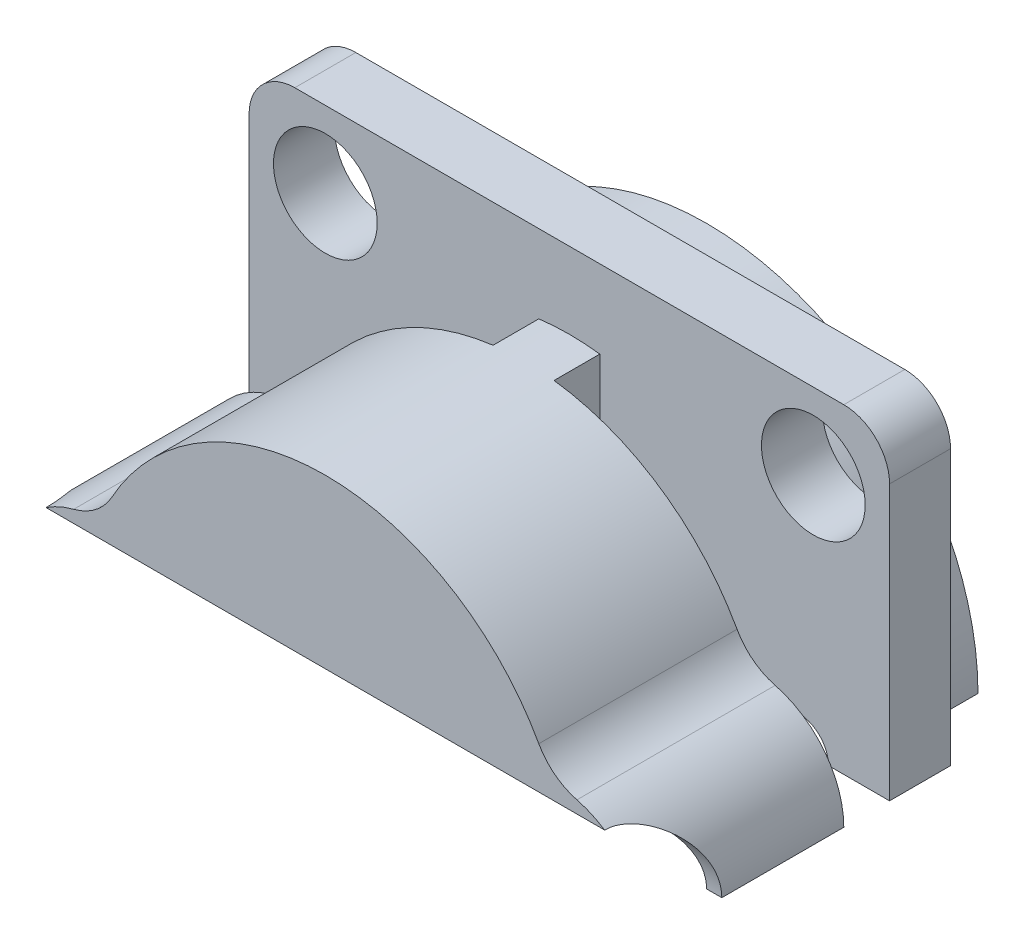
ISO-10303-21;
HEADER;
FILE_DESCRIPTION(('STEP AP214'),'2;1');
FILE_NAME('part.step','',(''),(''),'','','');
FILE_SCHEMA(('AUTOMOTIVE_DESIGN { 1 0 10303 214 1 1 1 1 }'));
ENDSEC;
DATA;
#1=APPLICATION_CONTEXT('core data for automotive mechanical design processes');
#2=APPLICATION_PROTOCOL_DEFINITION('international standard','automotive_design',2000,#1);
#3=PRODUCT_CONTEXT('',#1,'mechanical');
#4=PRODUCT('Part','Part','',(#3));
#5=PRODUCT_RELATED_PRODUCT_CATEGORY('part','',(#4));
#6=PRODUCT_DEFINITION_FORMATION('','',#4);
#7=PRODUCT_DEFINITION_CONTEXT('part definition',#1,'design');
#8=PRODUCT_DEFINITION('design','',#6,#7);
#9=PRODUCT_DEFINITION_SHAPE('','',#8);
#10=(LENGTH_UNIT() NAMED_UNIT(*) SI_UNIT(.MILLI.,.METRE.));
#11=(NAMED_UNIT(*) PLANE_ANGLE_UNIT() SI_UNIT($,.RADIAN.));
#12=(NAMED_UNIT(*) SI_UNIT($,.STERADIAN.) SOLID_ANGLE_UNIT());
#13=UNCERTAINTY_MEASURE_WITH_UNIT(LENGTH_MEASURE(1.E-05),#10,'distance_accuracy_value','');
#14=(GEOMETRIC_REPRESENTATION_CONTEXT(3) GLOBAL_UNCERTAINTY_ASSIGNED_CONTEXT((#13)) GLOBAL_UNIT_ASSIGNED_CONTEXT((#10,
#11,#12)) REPRESENTATION_CONTEXT('',''));
#15=CARTESIAN_POINT('',(0.,0.,0.));
#16=DIRECTION('',(0.,0.,1.));
#17=DIRECTION('',(1.,0.,0.));
#18=AXIS2_PLACEMENT_3D('',#15,#16,#17);
#19=CARTESIAN_POINT('',(-10.5,10.5,-2.5));
#20=DIRECTION('',(0.,0.,-1.));
#21=DIRECTION('',(-1.,0.,0.));
#22=AXIS2_PLACEMENT_3D('',#19,#20,#21);
#23=PLANE('',#22);
#24=DIRECTION('',(1.,0.,0.));
#25=VECTOR('',#24,1.);
#26=CARTESIAN_POINT('',(-10.5,10.5,-2.5));
#27=LINE('',#26,#25);
#28=CARTESIAN_POINT('',(-19.4,10.5,-2.5));
#29=VERTEX_POINT('',#28);
#30=CARTESIAN_POINT('',(-19.,10.5,-2.5));
#31=VERTEX_POINT('',#30);
#32=EDGE_CURVE('E638',#29,#31,#27,.T.);
#33=ORIENTED_EDGE('',*,*,#32,.F.);
#34=CARTESIAN_POINT('',(-10.5,10.5,-2.5));
#35=DIRECTION('',(0.,0.,-1.));
#36=DIRECTION('',(-1.,0.,0.));
#37=AXIS2_PLACEMENT_3D('',#34,#35,#36);
#38=CIRCLE('',#37,8.9);
#39=CARTESIAN_POINT('',(-1.6,10.5,-2.5));
#40=VERTEX_POINT('',#39);
#41=EDGE_CURVE('E591',#29,#40,#38,.T.);
#42=ORIENTED_EDGE('',*,*,#41,.T.);
#43=CARTESIAN_POINT('',(-2.00000000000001,10.5,-2.5));
#44=VERTEX_POINT('',#43);
#45=EDGE_CURVE('E704',#44,#40,#27,.T.);
#46=ORIENTED_EDGE('',*,*,#45,.F.);
#47=CARTESIAN_POINT('',(-3.,10.5,-2.5));
#48=DIRECTION('',(0.,0.,1.));
#49=DIRECTION('',(1.,0.,0.));
#50=AXIS2_PLACEMENT_3D('',#47,#48,#49);
#51=CIRCLE('',#50,0.999999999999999);
#52=CARTESIAN_POINT('',(-4.,10.5,-2.5));
#53=VERTEX_POINT('',#52);
#54=EDGE_CURVE('E479',#44,#53,#51,.T.);
#55=ORIENTED_EDGE('',*,*,#54,.T.);
#56=CARTESIAN_POINT('',(-5.96919630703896,10.5,-2.5));
#57=VERTEX_POINT('',#56);
#58=EDGE_CURVE('E697',#57,#53,#27,.T.);
#59=ORIENTED_EDGE('',*,*,#58,.F.);
#60=CARTESIAN_POINT('',(-10.5,10.5,-2.5));
#61=DIRECTION('',(0.,0.,-1.));
#62=DIRECTION('',(-1.,0.,0.));
#63=AXIS2_PLACEMENT_3D('',#60,#61,#62);
#64=CIRCLE('',#63,4.53080369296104);
#65=CARTESIAN_POINT('',(-15.030803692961,10.5,-2.5));
#66=VERTEX_POINT('',#65);
#67=EDGE_CURVE('E585',#66,#57,#64,.T.);
#68=ORIENTED_EDGE('',*,*,#67,.F.);
#69=CARTESIAN_POINT('',(-17.,10.5,-2.5));
#70=VERTEX_POINT('',#69);
#71=EDGE_CURVE('E690',#70,#66,#27,.T.);
#72=ORIENTED_EDGE('',*,*,#71,.F.);
#73=CARTESIAN_POINT('',(-18.,10.5,-2.5));
#74=DIRECTION('',(0.,0.,-1.));
#75=DIRECTION('',(-1.,0.,0.));
#76=AXIS2_PLACEMENT_3D('',#73,#74,#75);
#77=CIRCLE('',#76,0.999999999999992);
#78=EDGE_CURVE('E489',#31,#70,#77,.T.);
#79=ORIENTED_EDGE('',*,*,#78,.F.);
#80=EDGE_LOOP('',(#33,#42,#46,#55,#59,#68,#72,#79));
#81=FACE_BOUND('',#80,.T.);
#82=ADVANCED_FACE('F27',(#81),#23,.T.);
#83=CARTESIAN_POINT('',(0.,10.5,10.));
#84=DIRECTION('',(-1.,0.,0.));
#85=DIRECTION('',(0.,-1.,0.));
#86=AXIS2_PLACEMENT_3D('',#83,#84,#85);
#87=CYLINDRICAL_SURFACE('',#86,2.5);
#88=CARTESIAN_POINT('',(-10.5,10.5,10.));
#89=DIRECTION('',(-0.707106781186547,0.,-0.707106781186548));
#90=DIRECTION('',(0.707106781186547,0.,-0.707106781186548));
#91=AXIS2_PLACEMENT_3D('',#88,#89,#90);
#92=ELLIPSE('',#91,3.53553390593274,2.5);
#93=CARTESIAN_POINT('',(-8.,10.5,7.5));
#94=VERTEX_POINT('',#93);
#95=CARTESIAN_POINT('',(-10.5,13.,10.));
#96=VERTEX_POINT('',#95);
#97=EDGE_CURVE('E302',#94,#96,#92,.F.);
#98=ORIENTED_EDGE('',*,*,#97,.F.);
#99=DIRECTION('',(-1.,0.,0.));
#100=VECTOR('',#99,1.);
#101=CARTESIAN_POINT('',(0.,10.5,7.5));
#102=LINE('',#101,#100);
#103=CARTESIAN_POINT('',(-5.5,10.5,7.50000000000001));
#104=VERTEX_POINT('',#103);
#105=EDGE_CURVE('E657',#94,#104,#102,.F.);
#106=ORIENTED_EDGE('',*,*,#105,.T.);
#107=CARTESIAN_POINT('',(-3.,10.5,10.));
#108=DIRECTION('',(-0.707106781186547,0.,0.707106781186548));
#109=DIRECTION('',(-0.707106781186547,0.,-0.707106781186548));
#110=AXIS2_PLACEMENT_3D('',#107,#108,#109);
#111=ELLIPSE('',#110,3.53553390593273,2.5);
#112=CARTESIAN_POINT('',(-3.,13.,10.));
#113=VERTEX_POINT('',#112);
#114=EDGE_CURVE('E506',#104,#113,#111,.F.);
#115=ORIENTED_EDGE('',*,*,#114,.T.);
#116=DIRECTION('',(-1.,0.,0.));
#117=VECTOR('',#116,1.);
#118=CARTESIAN_POINT('',(0.,13.,10.));
#119=LINE('',#118,#117);
#120=EDGE_CURVE('E301',#113,#96,#119,.T.);
#121=ORIENTED_EDGE('',*,*,#120,.T.);
#122=EDGE_LOOP('',(#98,#106,#115,#121));
#123=FACE_BOUND('',#122,.T.);
#124=ADVANCED_FACE('F330',(#123),#87,.F.);
#125=CARTESIAN_POINT('',(-10.5,10.5,10.));
#126=DIRECTION('',(0.,0.,1.));
#127=DIRECTION('',(1.,0.,0.));
#128=AXIS2_PLACEMENT_3D('',#125,#126,#127);
#129=PLANE('',#128);
#130=CARTESIAN_POINT('',(-1.3416876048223,13.,10.));
#131=VERTEX_POINT('',#130);
#132=EDGE_CURVE('E305',#131,#113,#119,.T.);
#133=ORIENTED_EDGE('',*,*,#132,.F.);
#134=CARTESIAN_POINT('',(-3.,10.5,10.));
#135=DIRECTION('',(0.,0.,1.));
#136=DIRECTION('',(1.,0.,0.));
#137=AXIS2_PLACEMENT_3D('',#134,#135,#136);
#138=CIRCLE('',#137,3.);
#139=CARTESIAN_POINT('',(-2.25,13.4047375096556,10.));
#140=VERTEX_POINT('',#139);
#141=EDGE_CURVE('E300',#131,#140,#138,.T.);
#142=ORIENTED_EDGE('',*,*,#141,.T.);
#143=CARTESIAN_POINT('',(-1.75,15.3412291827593,10.));
#144=DIRECTION('',(0.,0.,1.));
#145=DIRECTION('',(1.,0.,0.));
#146=AXIS2_PLACEMENT_3D('',#143,#144,#145);
#147=CIRCLE('',#146,2.);
#148=CARTESIAN_POINT('',(-3.5,14.3729833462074,10.));
#149=VERTEX_POINT('',#148);
#150=EDGE_CURVE('E459',#140,#149,#147,.F.);
#151=ORIENTED_EDGE('',*,*,#150,.T.);
#152=CARTESIAN_POINT('',(-10.5,10.5,10.));
#153=DIRECTION('',(0.,0.,1.));
#154=DIRECTION('',(1.,0.,0.));
#155=AXIS2_PLACEMENT_3D('',#152,#153,#154);
#156=CIRCLE('',#155,8.);
#157=CARTESIAN_POINT('',(-17.5,14.3729833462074,10.));
#158=VERTEX_POINT('',#157);
#159=EDGE_CURVE('E609',#149,#158,#156,.T.);
#160=ORIENTED_EDGE('',*,*,#159,.T.);
#161=CARTESIAN_POINT('',(-19.25,15.3412291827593,10.));
#162=DIRECTION('',(0.,0.,1.));
#163=DIRECTION('',(1.,0.,0.));
#164=AXIS2_PLACEMENT_3D('',#161,#162,#163);
#165=CIRCLE('',#164,2.);
#166=CARTESIAN_POINT('',(-18.75,13.4047375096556,10.));
#167=VERTEX_POINT('',#166);
#168=EDGE_CURVE('E457',#158,#167,#165,.F.);
#169=ORIENTED_EDGE('',*,*,#168,.T.);
#170=CARTESIAN_POINT('',(-18.,10.5,10.));
#171=DIRECTION('',(0.,0.,1.));
#172=DIRECTION('',(1.,0.,0.));
#173=AXIS2_PLACEMENT_3D('',#170,#171,#172);
#174=CIRCLE('',#173,3.);
#175=CARTESIAN_POINT('',(-19.6583123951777,13.,10.));
#176=VERTEX_POINT('',#175);
#177=EDGE_CURVE('E580',#167,#176,#174,.T.);
#178=ORIENTED_EDGE('',*,*,#177,.T.);
#179=CARTESIAN_POINT('',(-18.,13.,10.));
#180=VERTEX_POINT('',#179);
#181=EDGE_CURVE('E308',#180,#176,#119,.T.);
#182=ORIENTED_EDGE('',*,*,#181,.F.);
#183=EDGE_CURVE('E307',#96,#180,#119,.T.);
#184=ORIENTED_EDGE('',*,*,#183,.F.);
#185=ORIENTED_EDGE('',*,*,#120,.F.);
#186=EDGE_LOOP('',(#133,#142,#151,#160,#169,#178,#182,#184,#185));
#187=FACE_BOUND('',#186,.T.);
#188=ADVANCED_FACE('F382',(#187),#129,.T.);
#189=CARTESIAN_POINT('',(-21.,0.,2.));
#190=DIRECTION('',(0.,0.,1.));
#191=DIRECTION('',(1.,0.,0.));
#192=AXIS2_PLACEMENT_3D('',#189,#190,#191);
#193=PLANE('',#192);
#194=DIRECTION('',(-1.,0.,0.));
#195=VECTOR('',#194,1.);
#196=CARTESIAN_POINT('',(-21.,10.5,2.));
#197=LINE('',#196,#195);
#198=CARTESIAN_POINT('',(0.,10.5,2.));
#199=VERTEX_POINT('',#198);
#200=CARTESIAN_POINT('',(-2.00000000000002,10.5,2.));
#201=VERTEX_POINT('',#200);
#202=EDGE_CURVE('E284',#199,#201,#197,.T.);
#203=ORIENTED_EDGE('',*,*,#202,.F.);
#204=DIRECTION('',(0.,1.,0.));
#205=VECTOR('',#204,1.);
#206=CARTESIAN_POINT('',(0.,21.,2.));
#207=LINE('',#206,#205);
#208=CARTESIAN_POINT('',(0.,19.5,2.));
#209=VERTEX_POINT('',#208);
#210=EDGE_CURVE('E410',#199,#209,#207,.T.);
#211=ORIENTED_EDGE('',*,*,#210,.T.);
#212=CARTESIAN_POINT('',(-1.5,19.5,2.));
#213=DIRECTION('',(0.,0.,1.));
#214=DIRECTION('',(1.,0.,0.));
#215=AXIS2_PLACEMENT_3D('',#212,#213,#214);
#216=CIRCLE('',#215,1.5);
#217=CARTESIAN_POINT('',(-1.5,21.,2.));
#218=VERTEX_POINT('',#217);
#219=EDGE_CURVE('E433',#209,#218,#216,.T.);
#220=ORIENTED_EDGE('',*,*,#219,.T.);
#221=DIRECTION('',(-1.,0.,0.));
#222=VECTOR('',#221,1.);
#223=CARTESIAN_POINT('',(-21.,21.,2.));
#224=LINE('',#223,#222);
#225=CARTESIAN_POINT('',(-19.5,21.,2.));
#226=VERTEX_POINT('',#225);
#227=EDGE_CURVE('E416',#218,#226,#224,.T.);
#228=ORIENTED_EDGE('',*,*,#227,.T.);
#229=CARTESIAN_POINT('',(-19.5,19.5,2.));
#230=DIRECTION('',(0.,0.,1.));
#231=DIRECTION('',(1.,0.,0.));
#232=AXIS2_PLACEMENT_3D('',#229,#230,#231);
#233=CIRCLE('',#232,1.5);
#234=CARTESIAN_POINT('',(-21.,19.5,2.));
#235=VERTEX_POINT('',#234);
#236=EDGE_CURVE('E435',#226,#235,#233,.T.);
#237=ORIENTED_EDGE('',*,*,#236,.T.);
#238=DIRECTION('',(0.,-1.,0.));
#239=VECTOR('',#238,1.);
#240=CARTESIAN_POINT('',(-21.,21.,2.));
#241=LINE('',#240,#239);
#242=CARTESIAN_POINT('',(-21.,10.5,2.));
#243=VERTEX_POINT('',#242);
#244=EDGE_CURVE('E417',#235,#243,#241,.T.);
#245=ORIENTED_EDGE('',*,*,#244,.T.);
#246=CARTESIAN_POINT('',(-19.,10.5,2.));
#247=VERTEX_POINT('',#246);
#248=EDGE_CURVE('E703',#247,#243,#197,.T.);
#249=ORIENTED_EDGE('',*,*,#248,.F.);
#250=CARTESIAN_POINT('',(-18.,10.5,2.));
#251=DIRECTION('',(0.,0.,1.));
#252=DIRECTION('',(1.,0.,0.));
#253=AXIS2_PLACEMENT_3D('',#250,#251,#252);
#254=CIRCLE('',#253,0.999999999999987);
#255=CARTESIAN_POINT('',(-17.,10.5,2.));
#256=VERTEX_POINT('',#255);
#257=EDGE_CURVE('E486',#256,#247,#254,.T.);
#258=ORIENTED_EDGE('',*,*,#257,.F.);
#259=CARTESIAN_POINT('',(-13.,10.5,2.));
#260=VERTEX_POINT('',#259);
#261=EDGE_CURVE('E695',#260,#256,#197,.T.);
#262=ORIENTED_EDGE('',*,*,#261,.F.);
#263=CARTESIAN_POINT('',(-10.5,10.5,2.));
#264=DIRECTION('',(0.,0.,-1.));
#265=DIRECTION('',(-1.,0.,0.));
#266=AXIS2_PLACEMENT_3D('',#263,#264,#265);
#267=CIRCLE('',#266,2.5);
#268=CARTESIAN_POINT('',(-11.5,12.7912878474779,2.));
#269=VERTEX_POINT('',#268);
#270=EDGE_CURVE('E539',#269,#260,#267,.F.);
#271=ORIENTED_EDGE('',*,*,#270,.F.);
#272=DIRECTION('',(0.,1.,0.));
#273=VECTOR('',#272,1.);
#274=CARTESIAN_POINT('',(-11.5,0.,2.));
#275=LINE('',#274,#273);
#276=CARTESIAN_POINT('',(-11.5,18.4372539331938,2.));
#277=VERTEX_POINT('',#276);
#278=EDGE_CURVE('E533',#269,#277,#275,.T.);
#279=ORIENTED_EDGE('',*,*,#278,.T.);
#280=CARTESIAN_POINT('',(-10.5,10.5,2.));
#281=DIRECTION('',(0.,0.,1.));
#282=DIRECTION('',(1.,0.,0.));
#283=AXIS2_PLACEMENT_3D('',#280,#281,#282);
#284=CIRCLE('',#283,8.);
#285=CARTESIAN_POINT('',(-9.5,18.4372539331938,2.));
#286=VERTEX_POINT('',#285);
#287=EDGE_CURVE('E606',#286,#277,#284,.T.);
#288=ORIENTED_EDGE('',*,*,#287,.F.);
#289=DIRECTION('',(0.,1.,0.));
#290=VECTOR('',#289,1.);
#291=CARTESIAN_POINT('',(-9.5,0.,2.));
#292=LINE('',#291,#290);
#293=CARTESIAN_POINT('',(-9.5,12.7912878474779,2.));
#294=VERTEX_POINT('',#293);
#295=EDGE_CURVE('E558',#294,#286,#292,.T.);
#296=ORIENTED_EDGE('',*,*,#295,.F.);
#297=CARTESIAN_POINT('',(-10.5,10.5,2.));
#298=DIRECTION('',(0.,0.,-1.));
#299=DIRECTION('',(-1.,0.,0.));
#300=AXIS2_PLACEMENT_3D('',#297,#298,#299);
#301=CIRCLE('',#300,2.5);
#302=CARTESIAN_POINT('',(-8.,10.5,2.));
#303=VERTEX_POINT('',#302);
#304=EDGE_CURVE('E562',#303,#294,#301,.F.);
#305=ORIENTED_EDGE('',*,*,#304,.F.);
#306=CARTESIAN_POINT('',(-4.,10.5,2.));
#307=VERTEX_POINT('',#306);
#308=EDGE_CURVE('E485',#307,#303,#197,.T.);
#309=ORIENTED_EDGE('',*,*,#308,.F.);
#310=CARTESIAN_POINT('',(-3.,10.5,2.));
#311=DIRECTION('',(0.,0.,1.));
#312=DIRECTION('',(1.,0.,0.));
#313=AXIS2_PLACEMENT_3D('',#310,#311,#312);
#314=CIRCLE('',#313,0.999999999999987);
#315=EDGE_CURVE('E477',#201,#307,#314,.T.);
#316=ORIENTED_EDGE('',*,*,#315,.F.);
#317=EDGE_LOOP('',(#203,#211,#220,#228,#237,#245,#249,#258,#262,#271,#279,#288,#296,#305,#309,#316));
#318=FACE_BOUND('',#317,.T.);
#319=CARTESIAN_POINT('',(-2.5,18.5,2.));
#320=DIRECTION('',(0.,0.,1.));
#321=DIRECTION('',(1.,0.,0.));
#322=AXIS2_PLACEMENT_3D('',#319,#320,#321);
#323=CIRCLE('',#322,1.69999999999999);
#324=CARTESIAN_POINT('',(-0.800000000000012,18.5,2.));
#325=VERTEX_POINT('',#324);
#326=EDGE_CURVE('E600',#325,#325,#323,.T.);
#327=ORIENTED_EDGE('',*,*,#326,.F.);
#328=EDGE_LOOP('',(#327));
#329=FACE_BOUND('',#328,.T.);
#330=CARTESIAN_POINT('',(-18.5,18.5,2.));
#331=DIRECTION('',(0.,0.,1.));
#332=DIRECTION('',(1.,0.,0.));
#333=AXIS2_PLACEMENT_3D('',#330,#331,#332);
#334=CIRCLE('',#333,1.69999999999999);
#335=CARTESIAN_POINT('',(-16.8,18.5,2.));
#336=VERTEX_POINT('',#335);
#337=EDGE_CURVE('E594',#336,#336,#334,.T.);
#338=ORIENTED_EDGE('',*,*,#337,.F.);
#339=EDGE_LOOP('',(#338));
#340=FACE_BOUND('',#339,.T.);
#341=ADVANCED_FACE('F385',(#318,#329,#340),#193,.T.);
#342=CARTESIAN_POINT('',(-10.5,10.5,10.));
#343=DIRECTION('',(0.,0.,-1.));
#344=DIRECTION('',(-1.,0.,0.));
#345=AXIS2_PLACEMENT_3D('',#342,#343,#344);
#346=CYLINDRICAL_SURFACE('',#345,8.);
#347=ORIENTED_EDGE('',*,*,#287,.T.);
#348=DIRECTION('',(0.,0.,-1.));
#349=VECTOR('',#348,1.);
#350=CARTESIAN_POINT('',(-11.5,18.4372539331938,10.));
#351=LINE('',#350,#349);
#352=CARTESIAN_POINT('',(-11.5,18.4372539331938,3.5));
#353=VERTEX_POINT('',#352);
#354=EDGE_CURVE('E555',#277,#353,#351,.F.);
#355=ORIENTED_EDGE('',*,*,#354,.T.);
#356=CARTESIAN_POINT('',(-10.5,10.5,3.5));
#357=DIRECTION('',(0.,0.,1.));
#358=DIRECTION('',(1.,0.,0.));
#359=AXIS2_PLACEMENT_3D('',#356,#357,#358);
#360=CIRCLE('',#359,8.);
#361=CARTESIAN_POINT('',(-17.5,14.3729833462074,3.5));
#362=VERTEX_POINT('',#361);
#363=EDGE_CURVE('E550',#353,#362,#360,.T.);
#364=ORIENTED_EDGE('',*,*,#363,.T.);
#365=DIRECTION('',(0.,0.,-1.));
#366=VECTOR('',#365,1.);
#367=CARTESIAN_POINT('',(-17.5,14.3729833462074,10.));
#368=LINE('',#367,#366);
#369=EDGE_CURVE('E453',#362,#158,#368,.F.);
#370=ORIENTED_EDGE('',*,*,#369,.T.);
#371=ORIENTED_EDGE('',*,*,#159,.F.);
#372=DIRECTION('',(0.,0.,-1.));
#373=VECTOR('',#372,1.);
#374=CARTESIAN_POINT('',(-3.5,14.3729833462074,10.));
#375=LINE('',#374,#373);
#376=CARTESIAN_POINT('',(-3.5,14.3729833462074,3.5));
#377=VERTEX_POINT('',#376);
#378=EDGE_CURVE('E450',#149,#377,#375,.T.);
#379=ORIENTED_EDGE('',*,*,#378,.T.);
#380=CARTESIAN_POINT('',(-10.5,10.5,3.5));
#381=DIRECTION('',(0.,0.,1.));
#382=DIRECTION('',(1.,0.,0.));
#383=AXIS2_PLACEMENT_3D('',#380,#381,#382);
#384=CIRCLE('',#383,8.);
#385=CARTESIAN_POINT('',(-9.5,18.4372539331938,3.5));
#386=VERTEX_POINT('',#385);
#387=EDGE_CURVE('E570',#377,#386,#384,.T.);
#388=ORIENTED_EDGE('',*,*,#387,.T.);
#389=DIRECTION('',(0.,0.,-1.));
#390=VECTOR('',#389,1.);
#391=CARTESIAN_POINT('',(-9.5,18.4372539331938,10.));
#392=LINE('',#391,#390);
#393=EDGE_CURVE('E576',#386,#286,#392,.T.);
#394=ORIENTED_EDGE('',*,*,#393,.T.);
#395=EDGE_LOOP('',(#347,#355,#364,#370,#371,#379,#388,#394));
#396=FACE_BOUND('',#395,.T.);
#397=ADVANCED_FACE('F387',(#396),#346,.T.);
#398=CARTESIAN_POINT('',(-21.,0.,0.));
#399=DIRECTION('',(0.,0.,1.));
#400=DIRECTION('',(1.,0.,0.));
#401=AXIS2_PLACEMENT_3D('',#398,#399,#400);
#402=PLANE('',#401);
#403=CARTESIAN_POINT('',(-2.5,18.5,0.));
#404=DIRECTION('',(0.,0.,1.));
#405=DIRECTION('',(1.,0.,0.));
#406=AXIS2_PLACEMENT_3D('',#403,#404,#405);
#407=CIRCLE('',#406,1.7);
#408=CARTESIAN_POINT('',(-0.800000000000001,18.5,0.));
#409=VERTEX_POINT('',#408);
#410=EDGE_CURVE('E603',#409,#409,#407,.T.);
#411=ORIENTED_EDGE('',*,*,#410,.T.);
#412=EDGE_LOOP('',(#411));
#413=FACE_BOUND('',#412,.T.);
#414=CARTESIAN_POINT('',(-18.5,18.5,0.));
#415=DIRECTION('',(0.,0.,1.));
#416=DIRECTION('',(1.,0.,0.));
#417=AXIS2_PLACEMENT_3D('',#414,#415,#416);
#418=CIRCLE('',#417,1.7);
#419=CARTESIAN_POINT('',(-16.8,18.5,0.));
#420=VERTEX_POINT('',#419);
#421=EDGE_CURVE('E597',#420,#420,#418,.T.);
#422=ORIENTED_EDGE('',*,*,#421,.T.);
#423=EDGE_LOOP('',(#422));
#424=FACE_BOUND('',#423,.T.);
#425=DIRECTION('',(0.,1.,0.));
#426=VECTOR('',#425,1.);
#427=CARTESIAN_POINT('',(0.,21.,0.));
#428=LINE('',#427,#426);
#429=CARTESIAN_POINT('',(0.,10.5,0.));
#430=VERTEX_POINT('',#429);
#431=CARTESIAN_POINT('',(0.,19.5,0.));
#432=VERTEX_POINT('',#431);
#433=EDGE_CURVE('E615',#430,#432,#428,.T.);
#434=ORIENTED_EDGE('',*,*,#433,.F.);
#435=DIRECTION('',(-1.,0.,0.));
#436=VECTOR('',#435,1.);
#437=CARTESIAN_POINT('',(-21.,10.5,0.));
#438=LINE('',#437,#436);
#439=CARTESIAN_POINT('',(-1.6,10.5,0.));
#440=VERTEX_POINT('',#439);
#441=EDGE_CURVE('E636',#430,#440,#438,.T.);
#442=ORIENTED_EDGE('',*,*,#441,.T.);
#443=CARTESIAN_POINT('',(-10.5,10.5,0.));
#444=DIRECTION('',(0.,0.,1.));
#445=DIRECTION('',(1.,0.,0.));
#446=AXIS2_PLACEMENT_3D('',#443,#444,#445);
#447=CIRCLE('',#446,8.9);
#448=CARTESIAN_POINT('',(-19.4,10.5,0.));
#449=VERTEX_POINT('',#448);
#450=EDGE_CURVE('E444',#449,#440,#447,.F.);
#451=ORIENTED_EDGE('',*,*,#450,.F.);
#452=CARTESIAN_POINT('',(-21.,10.5,0.));
#453=VERTEX_POINT('',#452);
#454=EDGE_CURVE('E631',#449,#453,#438,.T.);
#455=ORIENTED_EDGE('',*,*,#454,.T.);
#456=DIRECTION('',(0.,-1.,0.));
#457=VECTOR('',#456,1.);
#458=CARTESIAN_POINT('',(-21.,21.,0.));
#459=LINE('',#458,#457);
#460=CARTESIAN_POINT('',(-21.,19.5,0.));
#461=VERTEX_POINT('',#460);
#462=EDGE_CURVE('E612',#461,#453,#459,.T.);
#463=ORIENTED_EDGE('',*,*,#462,.F.);
#464=CARTESIAN_POINT('',(-19.5,19.5,0.));
#465=DIRECTION('',(0.,0.,1.));
#466=DIRECTION('',(1.,0.,0.));
#467=AXIS2_PLACEMENT_3D('',#464,#465,#466);
#468=CIRCLE('',#467,1.5);
#469=CARTESIAN_POINT('',(-19.5,21.,0.));
#470=VERTEX_POINT('',#469);
#471=EDGE_CURVE('E428',#461,#470,#468,.F.);
#472=ORIENTED_EDGE('',*,*,#471,.T.);
#473=DIRECTION('',(-1.,0.,0.));
#474=VECTOR('',#473,1.);
#475=CARTESIAN_POINT('',(-21.,21.,0.));
#476=LINE('',#475,#474);
#477=CARTESIAN_POINT('',(-1.5,21.,0.));
#478=VERTEX_POINT('',#477);
#479=EDGE_CURVE('E422',#478,#470,#476,.T.);
#480=ORIENTED_EDGE('',*,*,#479,.F.);
#481=CARTESIAN_POINT('',(-1.5,19.5,0.));
#482=DIRECTION('',(0.,0.,1.));
#483=DIRECTION('',(1.,0.,0.));
#484=AXIS2_PLACEMENT_3D('',#481,#482,#483);
#485=CIRCLE('',#484,1.5);
#486=EDGE_CURVE('E419',#478,#432,#485,.F.);
#487=ORIENTED_EDGE('',*,*,#486,.T.);
#488=EDGE_LOOP('',(#434,#442,#451,#455,#463,#472,#480,#487));
#489=FACE_BOUND('',#488,.T.);
#490=ADVANCED_FACE('F390',(#413,#424,#489),#402,.F.);
#491=CARTESIAN_POINT('',(-21.,21.,2.));
#492=DIRECTION('',(1.,0.,0.));
#493=DIRECTION('',(0.,1.,0.));
#494=AXIS2_PLACEMENT_3D('',#491,#492,#493);
#495=PLANE('',#494);
#496=ORIENTED_EDGE('',*,*,#462,.T.);
#497=DIRECTION('',(0.,0.,1.));
#498=VECTOR('',#497,1.);
#499=CARTESIAN_POINT('',(-21.,10.5,2.));
#500=LINE('',#499,#498);
#501=EDGE_CURVE('E628',#453,#243,#500,.T.);
#502=ORIENTED_EDGE('',*,*,#501,.T.);
#503=ORIENTED_EDGE('',*,*,#244,.F.);
#504=DIRECTION('',(0.,0.,-1.));
#505=VECTOR('',#504,1.);
#506=CARTESIAN_POINT('',(-21.,19.5,2.));
#507=LINE('',#506,#505);
#508=EDGE_CURVE('E430',#235,#461,#507,.T.);
#509=ORIENTED_EDGE('',*,*,#508,.T.);
#510=EDGE_LOOP('',(#496,#502,#503,#509));
#511=FACE_BOUND('',#510,.T.);
#512=ADVANCED_FACE('F29',(#511),#495,.F.);
#513=CARTESIAN_POINT('',(0.,21.,2.));
#514=DIRECTION('',(-1.,0.,0.));
#515=DIRECTION('',(0.,-1.,0.));
#516=AXIS2_PLACEMENT_3D('',#513,#514,#515);
#517=PLANE('',#516);
#518=ORIENTED_EDGE('',*,*,#210,.F.);
#519=DIRECTION('',(0.,0.,-1.));
#520=VECTOR('',#519,1.);
#521=CARTESIAN_POINT('',(0.,10.5,10.));
#522=LINE('',#521,#520);
#523=EDGE_CURVE('E285',#199,#430,#522,.T.);
#524=ORIENTED_EDGE('',*,*,#523,.T.);
#525=ORIENTED_EDGE('',*,*,#433,.T.);
#526=DIRECTION('',(0.,0.,-1.));
#527=VECTOR('',#526,1.);
#528=CARTESIAN_POINT('',(0.,19.5,2.));
#529=LINE('',#528,#527);
#530=EDGE_CURVE('E413',#432,#209,#529,.F.);
#531=ORIENTED_EDGE('',*,*,#530,.T.);
#532=EDGE_LOOP('',(#518,#524,#525,#531));
#533=FACE_BOUND('',#532,.T.);
#534=ADVANCED_FACE('F399',(#533),#517,.F.);
#535=CARTESIAN_POINT('',(-21.,21.,2.));
#536=DIRECTION('',(0.,-1.,0.));
#537=DIRECTION('',(0.,0.,-1.));
#538=AXIS2_PLACEMENT_3D('',#535,#536,#537);
#539=PLANE('',#538);
#540=ORIENTED_EDGE('',*,*,#479,.T.);
#541=DIRECTION('',(0.,0.,-1.));
#542=VECTOR('',#541,1.);
#543=CARTESIAN_POINT('',(-19.5,21.,2.));
#544=LINE('',#543,#542);
#545=EDGE_CURVE('E440',#470,#226,#544,.F.);
#546=ORIENTED_EDGE('',*,*,#545,.T.);
#547=ORIENTED_EDGE('',*,*,#227,.F.);
#548=DIRECTION('',(0.,0.,-1.));
#549=VECTOR('',#548,1.);
#550=CARTESIAN_POINT('',(-1.5,21.,2.));
#551=LINE('',#550,#549);
#552=EDGE_CURVE('E437',#218,#478,#551,.T.);
#553=ORIENTED_EDGE('',*,*,#552,.T.);
#554=EDGE_LOOP('',(#540,#546,#547,#553));
#555=FACE_BOUND('',#554,.T.);
#556=ADVANCED_FACE('F380',(#555),#539,.F.);
#557=CARTESIAN_POINT('',(-2.5,18.5,2.));
#558=DIRECTION('',(0.,0.,1.));
#559=DIRECTION('',(1.,0.,0.));
#560=AXIS2_PLACEMENT_3D('',#557,#558,#559);
#561=CYLINDRICAL_SURFACE('',#560,1.69999999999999);
#562=ORIENTED_EDGE('',*,*,#410,.F.);
#563=EDGE_LOOP('',(#562));
#564=FACE_BOUND('',#563,.T.);
#565=ORIENTED_EDGE('',*,*,#326,.T.);
#566=EDGE_LOOP('',(#565));
#567=FACE_BOUND('',#566,.T.);
#568=ADVANCED_FACE('F376',(#564,#567),#561,.F.);
#569=CARTESIAN_POINT('',(-18.5,18.5,2.));
#570=DIRECTION('',(0.,0.,1.));
#571=DIRECTION('',(1.,0.,0.));
#572=AXIS2_PLACEMENT_3D('',#569,#570,#571);
#573=CYLINDRICAL_SURFACE('',#572,1.69999999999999);
#574=ORIENTED_EDGE('',*,*,#421,.F.);
#575=EDGE_LOOP('',(#574));
#576=FACE_BOUND('',#575,.T.);
#577=ORIENTED_EDGE('',*,*,#337,.T.);
#578=EDGE_LOOP('',(#577));
#579=FACE_BOUND('',#578,.T.);
#580=ADVANCED_FACE('F372',(#576,#579),#573,.F.);
#581=CARTESIAN_POINT('',(-19.5,19.5,2.));
#582=DIRECTION('',(0.,0.,-1.));
#583=DIRECTION('',(-1.,0.,0.));
#584=AXIS2_PLACEMENT_3D('',#581,#582,#583);
#585=CYLINDRICAL_SURFACE('',#584,1.5);
#586=ORIENTED_EDGE('',*,*,#236,.F.);
#587=ORIENTED_EDGE('',*,*,#545,.F.);
#588=ORIENTED_EDGE('',*,*,#471,.F.);
#589=ORIENTED_EDGE('',*,*,#508,.F.);
#590=EDGE_LOOP('',(#586,#587,#588,#589));
#591=FACE_BOUND('',#590,.T.);
#592=ADVANCED_FACE('F368',(#591),#585,.T.);
#593=CARTESIAN_POINT('',(-1.5,19.5,2.));
#594=DIRECTION('',(0.,0.,-1.));
#595=DIRECTION('',(-1.,0.,0.));
#596=AXIS2_PLACEMENT_3D('',#593,#594,#595);
#597=CYLINDRICAL_SURFACE('',#596,1.5);
#598=ORIENTED_EDGE('',*,*,#219,.F.);
#599=ORIENTED_EDGE('',*,*,#530,.F.);
#600=ORIENTED_EDGE('',*,*,#486,.F.);
#601=ORIENTED_EDGE('',*,*,#552,.F.);
#602=EDGE_LOOP('',(#598,#599,#600,#601));
#603=FACE_BOUND('',#602,.T.);
#604=ADVANCED_FACE('F364',(#603),#597,.T.);
#605=CARTESIAN_POINT('',(-10.5,10.5,-2.5));
#606=DIRECTION('',(0.,0.,1.));
#607=DIRECTION('',(1.,0.,0.));
#608=AXIS2_PLACEMENT_3D('',#605,#606,#607);
#609=CYLINDRICAL_SURFACE('',#608,8.9);
#610=ORIENTED_EDGE('',*,*,#41,.F.);
#611=DIRECTION('',(0.,0.,1.));
#612=VECTOR('',#611,1.);
#613=CARTESIAN_POINT('',(-19.4,10.5,-2.5));
#614=LINE('',#613,#612);
#615=EDGE_CURVE('E632',#29,#449,#614,.T.);
#616=ORIENTED_EDGE('',*,*,#615,.T.);
#617=ORIENTED_EDGE('',*,*,#450,.T.);
#618=DIRECTION('',(0.,0.,1.));
#619=VECTOR('',#618,1.);
#620=CARTESIAN_POINT('',(-1.6,10.5,-2.5));
#621=LINE('',#620,#619);
#622=EDGE_CURVE('E710',#440,#40,#621,.F.);
#623=ORIENTED_EDGE('',*,*,#622,.T.);
#624=EDGE_LOOP('',(#610,#616,#617,#623));
#625=FACE_BOUND('',#624,.T.);
#626=ADVANCED_FACE('F357',(#625),#609,.T.);
#627=CARTESIAN_POINT('',(-10.5,10.5,0.));
#628=DIRECTION('',(0.,0.,-1.));
#629=DIRECTION('',(-1.,0.,0.));
#630=AXIS2_PLACEMENT_3D('',#627,#628,#629);
#631=CYLINDRICAL_SURFACE('',#630,4.53080369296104);
#632=ORIENTED_EDGE('',*,*,#67,.T.);
#633=DIRECTION('',(0.,0.,-1.));
#634=VECTOR('',#633,1.);
#635=CARTESIAN_POINT('',(-5.96919630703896,10.5,0.));
#636=LINE('',#635,#634);
#637=CARTESIAN_POINT('',(-5.96919630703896,10.5,0.));
#638=VERTEX_POINT('',#637);
#639=EDGE_CURVE('E718',#57,#638,#636,.F.);
#640=ORIENTED_EDGE('',*,*,#639,.T.);
#641=CARTESIAN_POINT('',(-10.5,10.5,0.));
#642=DIRECTION('',(0.,0.,-1.));
#643=DIRECTION('',(-1.,0.,0.));
#644=AXIS2_PLACEMENT_3D('',#641,#642,#643);
#645=CIRCLE('',#644,4.53080369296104);
#646=CARTESIAN_POINT('',(-15.030803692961,10.5,0.));
#647=VERTEX_POINT('',#646);
#648=EDGE_CURVE('E588',#647,#638,#645,.T.);
#649=ORIENTED_EDGE('',*,*,#648,.F.);
#650=DIRECTION('',(0.,0.,-1.));
#651=VECTOR('',#650,1.);
#652=CARTESIAN_POINT('',(-15.030803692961,10.5,0.));
#653=LINE('',#652,#651);
#654=EDGE_CURVE('E692',#647,#66,#653,.T.);
#655=ORIENTED_EDGE('',*,*,#654,.T.);
#656=EDGE_LOOP('',(#632,#640,#649,#655));
#657=FACE_BOUND('',#656,.T.);
#658=ADVANCED_FACE('F353',(#657),#631,.F.);
#659=CARTESIAN_POINT('',(-10.5,10.5,0.));
#660=DIRECTION('',(0.,0.,-1.));
#661=DIRECTION('',(-1.,0.,0.));
#662=AXIS2_PLACEMENT_3D('',#659,#660,#661);
#663=PLANE('',#662);
#664=DIRECTION('',(1.,0.,0.));
#665=VECTOR('',#664,1.);
#666=CARTESIAN_POINT('',(-10.5,10.5,0.));
#667=LINE('',#666,#665);
#668=CARTESIAN_POINT('',(-13.,10.5,0.));
#669=VERTEX_POINT('',#668);
#670=EDGE_CURVE('E689',#647,#669,#667,.T.);
#671=ORIENTED_EDGE('',*,*,#670,.F.);
#672=ORIENTED_EDGE('',*,*,#648,.T.);
#673=CARTESIAN_POINT('',(-8.,10.5,0.));
#674=VERTEX_POINT('',#673);
#675=EDGE_CURVE('E694',#674,#638,#667,.T.);
#676=ORIENTED_EDGE('',*,*,#675,.F.);
#677=CARTESIAN_POINT('',(-10.5,10.5,0.));
#678=DIRECTION('',(0.,0.,-1.));
#679=DIRECTION('',(-1.,0.,0.));
#680=AXIS2_PLACEMENT_3D('',#677,#678,#679);
#681=CIRCLE('',#680,2.5);
#682=EDGE_CURVE('E582',#669,#674,#681,.T.);
#683=ORIENTED_EDGE('',*,*,#682,.F.);
#684=EDGE_LOOP('',(#671,#672,#676,#683));
#685=FACE_BOUND('',#684,.T.);
#686=ADVANCED_FACE('F349',(#685),#663,.T.);
#687=CARTESIAN_POINT('',(-10.5,10.5,10.001));
#688=DIRECTION('',(0.,0.,-1.));
#689=DIRECTION('',(-1.,0.,0.));
#690=AXIS2_PLACEMENT_3D('',#687,#688,#689);
#691=CYLINDRICAL_SURFACE('',#690,2.5);
#692=ORIENTED_EDGE('',*,*,#682,.T.);
#693=DIRECTION('',(0.,0.,-1.));
#694=VECTOR('',#693,1.);
#695=CARTESIAN_POINT('',(-8.,10.5,10.001));
#696=LINE('',#695,#694);
#697=EDGE_CURVE('E706',#674,#303,#696,.F.);
#698=ORIENTED_EDGE('',*,*,#697,.T.);
#699=ORIENTED_EDGE('',*,*,#304,.T.);
#700=DIRECTION('',(0.,0.,-1.));
#701=VECTOR('',#700,1.);
#702=CARTESIAN_POINT('',(-9.5,12.7912878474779,10.001));
#703=LINE('',#702,#701);
#704=CARTESIAN_POINT('',(-9.5,12.7912878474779,3.5));
#705=VERTEX_POINT('',#704);
#706=EDGE_CURVE('E461',#294,#705,#703,.F.);
#707=ORIENTED_EDGE('',*,*,#706,.T.);
#708=CARTESIAN_POINT('',(-10.5,10.5,3.5));
#709=DIRECTION('',(0.,0.,1.));
#710=DIRECTION('',(1.,0.,0.));
#711=AXIS2_PLACEMENT_3D('',#708,#709,#710);
#712=CIRCLE('',#711,2.5);
#713=CARTESIAN_POINT('',(-8.,10.5,3.5));
#714=VERTEX_POINT('',#713);
#715=EDGE_CURVE('E573',#705,#714,#712,.F.);
#716=ORIENTED_EDGE('',*,*,#715,.T.);
#717=EDGE_CURVE('E660',#714,#94,#696,.F.);
#718=ORIENTED_EDGE('',*,*,#717,.T.);
#719=ORIENTED_EDGE('',*,*,#97,.T.);
#720=CARTESIAN_POINT('',(-10.5,10.5,10.));
#721=DIRECTION('',(0.707106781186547,0.,-0.707106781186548));
#722=DIRECTION('',(-0.707106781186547,0.,-0.707106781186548));
#723=AXIS2_PLACEMENT_3D('',#720,#721,#722);
#724=ELLIPSE('',#723,3.53553390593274,2.5);
#725=CARTESIAN_POINT('',(-13.,10.5,7.5));
#726=VERTEX_POINT('',#725);
#727=EDGE_CURVE('E309',#96,#726,#724,.F.);
#728=ORIENTED_EDGE('',*,*,#727,.T.);
#729=DIRECTION('',(0.,0.,-1.));
#730=VECTOR('',#729,1.);
#731=CARTESIAN_POINT('',(-13.,10.5,10.001));
#732=LINE('',#731,#730);
#733=CARTESIAN_POINT('',(-13.,10.5,3.5));
#734=VERTEX_POINT('',#733);
#735=EDGE_CURVE('E42',#726,#734,#732,.T.);
#736=ORIENTED_EDGE('',*,*,#735,.T.);
#737=CARTESIAN_POINT('',(-10.5,10.5,3.5));
#738=DIRECTION('',(0.,0.,1.));
#739=DIRECTION('',(1.,0.,0.));
#740=AXIS2_PLACEMENT_3D('',#737,#738,#739);
#741=CIRCLE('',#740,2.5);
#742=CARTESIAN_POINT('',(-11.5,12.7912878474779,3.5));
#743=VERTEX_POINT('',#742);
#744=EDGE_CURVE('E553',#734,#743,#741,.F.);
#745=ORIENTED_EDGE('',*,*,#744,.T.);
#746=DIRECTION('',(0.,0.,-1.));
#747=VECTOR('',#746,1.);
#748=CARTESIAN_POINT('',(-11.5,12.7912878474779,10.001));
#749=LINE('',#748,#747);
#750=EDGE_CURVE('E464',#743,#269,#749,.T.);
#751=ORIENTED_EDGE('',*,*,#750,.T.);
#752=ORIENTED_EDGE('',*,*,#270,.T.);
#753=EDGE_CURVE('E684',#260,#669,#732,.T.);
#754=ORIENTED_EDGE('',*,*,#753,.T.);
#755=EDGE_LOOP('',(#692,#698,#699,#707,#716,#718,#719,#728,#736,#745,#751,#752,#754));
#756=FACE_BOUND('',#755,.T.);
#757=ADVANCED_FACE('F345',(#756),#691,.F.);
#758=CARTESIAN_POINT('',(-18.,10.5,10.));
#759=DIRECTION('',(0.,0.,-1.));
#760=DIRECTION('',(-1.,0.,0.));
#761=AXIS2_PLACEMENT_3D('',#758,#759,#760);
#762=CYLINDRICAL_SURFACE('',#761,3.);
#763=CARTESIAN_POINT('',(-18.,10.5,3.5));
#764=DIRECTION('',(0.,0.,1.));
#765=DIRECTION('',(1.,0.,0.));
#766=AXIS2_PLACEMENT_3D('',#763,#764,#765);
#767=CIRCLE('',#766,3.);
#768=CARTESIAN_POINT('',(-18.75,13.4047375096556,3.5));
#769=VERTEX_POINT('',#768);
#770=CARTESIAN_POINT('',(-21.,10.5,3.5));
#771=VERTEX_POINT('',#770);
#772=EDGE_CURVE('E544',#769,#771,#767,.T.);
#773=ORIENTED_EDGE('',*,*,#772,.T.);
#774=DIRECTION('',(0.,0.,-1.));
#775=VECTOR('',#774,1.);
#776=CARTESIAN_POINT('',(-21.,10.5,10.));
#777=LINE('',#776,#775);
#778=CARTESIAN_POINT('',(-21.,10.5,7.5));
#779=VERTEX_POINT('',#778);
#780=EDGE_CURVE('E663',#771,#779,#777,.F.);
#781=ORIENTED_EDGE('',*,*,#780,.T.);
#782=CARTESIAN_POINT('',(-19.6583123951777,8.,10.));
#783=CARTESIAN_POINT('',(-19.6582802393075,7.99998946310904,9.95533238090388));
#784=CARTESIAN_POINT('',(-19.6601162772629,8.0011966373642,9.91068532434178));
#785=CARTESIAN_POINT('',(-19.6672731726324,8.00596054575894,9.82188119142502));
#786=CARTESIAN_POINT('',(-19.6725873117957,8.00951275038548,9.77772333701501));
#787=CARTESIAN_POINT('',(-19.6863489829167,8.01881276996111,9.69081344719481));
#788=CARTESIAN_POINT('',(-19.6947494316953,8.02452762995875,9.64805029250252));
#789=CARTESIAN_POINT('',(-19.7143090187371,8.03803168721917,9.56348315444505));
#790=CARTESIAN_POINT('',(-19.7254696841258,8.0458220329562,9.5216797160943));
#791=CARTESIAN_POINT('',(-19.7722269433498,8.07905430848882,9.36527357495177));
#792=CARTESIAN_POINT('',(-19.8157824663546,8.11111734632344,9.25440900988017));
#793=CARTESIAN_POINT('',(-19.9130905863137,8.18829694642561,9.04133278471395));
#794=CARTESIAN_POINT('',(-19.966926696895,8.23352212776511,8.93920266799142));
#795=CARTESIAN_POINT('',(-20.0633380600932,8.32154860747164,8.77091282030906));
#796=CARTESIAN_POINT('',(-20.1048774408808,8.36152160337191,8.70265272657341));
#797=CARTESIAN_POINT('',(-20.188773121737,8.44746839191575,8.57054783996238));
#798=CARTESIAN_POINT('',(-20.2311297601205,8.49344471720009,8.50670492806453));
#799=CARTESIAN_POINT('',(-20.3573792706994,8.64007664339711,8.32209953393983));
#800=CARTESIAN_POINT('',(-20.4407338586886,8.74967833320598,8.20779776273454));
#801=CARTESIAN_POINT('',(-20.5810766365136,8.96667683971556,8.0214151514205));
#802=CARTESIAN_POINT('',(-20.639910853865,9.06962819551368,7.94551882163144));
#803=CARTESIAN_POINT('',(-20.7477468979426,9.28970064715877,7.80867666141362));
#804=CARTESIAN_POINT('',(-20.7967624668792,9.40680156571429,7.74770990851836));
#805=CARTESIAN_POINT('',(-20.8737298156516,9.63207111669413,7.6528864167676));
#806=CARTESIAN_POINT('',(-20.903858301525,9.7382829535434,7.61616482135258));
#807=CARTESIAN_POINT('',(-20.9526044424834,9.95716955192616,7.55701885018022));
#808=CARTESIAN_POINT('',(-20.9712291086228,10.0698403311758,7.53458576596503));
#809=CARTESIAN_POINT('',(-20.9954915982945,10.2990937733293,7.50539850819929));
#810=CARTESIAN_POINT('',(-21.0010748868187,10.4156908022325,7.49871017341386));
#811=CARTESIAN_POINT('',(-20.9985814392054,10.6485273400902,7.50170224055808));
#812=CARTESIAN_POINT('',(-20.9905049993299,10.7647668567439,7.51138228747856));
#813=CARTESIAN_POINT('',(-20.9624133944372,10.9854457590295,7.54521420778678));
#814=CARTESIAN_POINT('',(-20.9432360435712,11.0901534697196,7.56835099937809));
#815=CARTESIAN_POINT('',(-20.8950132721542,11.2936257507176,7.62694764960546));
#816=CARTESIAN_POINT('',(-20.8659663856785,11.3923894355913,7.6624093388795));
#817=CARTESIAN_POINT('',(-20.7969028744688,11.5905341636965,7.74759139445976));
#818=CARTESIAN_POINT('',(-20.7561602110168,11.6892447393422,7.79827228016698));
#819=CARTESIAN_POINT('',(-20.6674471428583,11.8767800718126,7.91039730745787));
#820=CARTESIAN_POINT('',(-20.6194703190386,11.9655959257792,7.97185101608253));
#821=CARTESIAN_POINT('',(-20.4944880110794,12.1728036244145,8.13545919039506));
#822=CARTESIAN_POINT('',(-20.4145281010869,12.2851738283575,8.24307095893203));
#823=CARTESIAN_POINT('',(-20.2920397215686,12.4367015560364,8.41723986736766));
#824=CARTESIAN_POINT('',(-20.2507264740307,12.4844271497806,8.4775138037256));
#825=CARTESIAN_POINT('',(-20.1682838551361,12.5741868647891,8.60227177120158));
#826=CARTESIAN_POINT('',(-20.1271544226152,12.6162230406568,8.66675426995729));
#827=CARTESIAN_POINT('',(-20.0273666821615,12.7128219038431,8.83110709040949));
#828=CARTESIAN_POINT('',(-19.9694941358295,12.7640644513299,8.93343837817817));
#829=CARTESIAN_POINT('',(-19.862150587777,12.8531315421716,9.14783771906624));
#830=CARTESIAN_POINT('',(-19.8126577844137,12.890991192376,9.25987932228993));
#831=CARTESIAN_POINT('',(-19.7431252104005,12.9418792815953,9.45763187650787));
#832=CARTESIAN_POINT('',(-19.7187117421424,12.958967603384,9.54072143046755));
#833=CARTESIAN_POINT('',(-19.6813607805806,12.9846653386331,9.71061722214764));
#834=CARTESIAN_POINT('',(-19.6683802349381,12.9933065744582,9.79740821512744));
#835=CARTESIAN_POINT('',(-19.6609801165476,12.9982281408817,9.90392747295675));
#836=CARTESIAN_POINT('',(-19.6599814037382,12.9988919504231,9.9231185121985));
#837=CARTESIAN_POINT('',(-19.6586484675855,12.999777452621,9.96153766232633));
#838=CARTESIAN_POINT('',(-19.6583143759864,12.9999990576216,9.98076577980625));
#839=CARTESIAN_POINT('',(-19.6583123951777,13.,10.));
#840=B_SPLINE_CURVE_WITH_KNOTS('',3,(#782,#783,#784,#785,#786,#787,#788,#789,#790,#791,#792,
#793,#794,#795,#796,#797,#798,#799,#800,#801,#802,#803,#804,#805,#806,#807,#808,#809,#810,#811,
#812,#813,#814,#815,#816,#817,#818,#819,#820,#821,#822,#823,#824,#825,#826,#827,#828,#829,#830,
#831,#832,#833,#834,#835,#836,#837,#838,#839),.UNSPECIFIED.,.F.,.F.,(4,2,2,2,2,2,2,2,2,2,2,2,2,
2,2,2,2,2,2,2,2,2,2,2,2,2,2,2,4),(0.,0.133915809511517,0.267573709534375,0.399271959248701,
0.531043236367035,0.898867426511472,1.26981755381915,1.53753000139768,1.8053557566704,
2.33924592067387,2.76010881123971,3.18037848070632,3.5279765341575,3.87536253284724,
4.22419861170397,4.5730271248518,4.89843954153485,5.22390031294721,5.57721326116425,
5.93084158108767,6.45264424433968,6.71427180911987,6.97580463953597,7.35949670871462,
7.74217465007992,8.00607441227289,8.26897611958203,8.32665105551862,8.38433742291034),.UNSPECIFIED.);
#841=EDGE_CURVE('E336',#779,#176,#840,.T.);
#842=ORIENTED_EDGE('',*,*,#841,.T.);
#843=ORIENTED_EDGE('',*,*,#177,.F.);
#844=DIRECTION('',(0.,0.,-1.));
#845=VECTOR('',#844,1.);
#846=CARTESIAN_POINT('',(-18.75,13.4047375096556,10.));
#847=LINE('',#846,#845);
#848=EDGE_CURVE('E447',#167,#769,#847,.T.);
#849=ORIENTED_EDGE('',*,*,#848,.T.);
#850=EDGE_LOOP('',(#773,#781,#842,#843,#849));
#851=FACE_BOUND('',#850,.T.);
#852=ADVANCED_FACE('F341',(#851),#762,.T.);
#853=CARTESIAN_POINT('',(-3.,10.5,10.));
#854=DIRECTION('',(0.,0.,-1.));
#855=DIRECTION('',(-1.,0.,0.));
#856=AXIS2_PLACEMENT_3D('',#853,#854,#855);
#857=CYLINDRICAL_SURFACE('',#856,3.);
#858=CARTESIAN_POINT('',(0.,10.5,7.5));
#859=CARTESIAN_POINT('',(-4.77204794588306E-06,10.3812424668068,7.50000488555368));
#860=CARTESIAN_POINT('',(-0.00711329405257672,10.2624487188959,7.50852250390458));
#861=CARTESIAN_POINT('',(-0.034892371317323,10.0288175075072,7.54196272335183));
#862=CARTESIAN_POINT('',(-0.055572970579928,9.91398304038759,7.56689747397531));
#863=CARTESIAN_POINT('',(-0.108573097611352,9.69217005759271,7.6313121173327));
#864=CARTESIAN_POINT('',(-0.140823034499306,9.5851490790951,7.67070507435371));
#865=CARTESIAN_POINT('',(-0.214708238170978,9.38015860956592,7.76201704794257));
#866=CARTESIAN_POINT('',(-0.256346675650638,9.28219219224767,7.81394029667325));
#867=CARTESIAN_POINT('',(-0.363258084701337,9.06210001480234,7.94945374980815));
#868=CARTESIAN_POINT('',(-0.431594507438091,8.94431780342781,8.03767020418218));
#869=CARTESIAN_POINT('',(-0.575773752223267,8.72797601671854,8.23052432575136));
#870=CARTESIAN_POINT('',(-0.651637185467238,8.62947154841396,8.3352075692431));
#871=CARTESIAN_POINT('',(-0.767051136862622,8.49562736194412,8.50408427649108));
#872=CARTESIAN_POINT('',(-0.806163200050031,8.45300273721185,8.5629555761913));
#873=CARTESIAN_POINT('',(-0.883793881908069,8.37284704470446,8.6845056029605));
#874=CARTESIAN_POINT('',(-0.922312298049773,8.33531768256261,8.74718559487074));
#875=CARTESIAN_POINT('',(-0.997494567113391,8.26558877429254,8.87626732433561));
#876=CARTESIAN_POINT('',(-1.0341626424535,8.23337667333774,8.94265978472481));
#877=CARTESIAN_POINT('',(-1.10422313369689,8.17446309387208,9.07944628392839));
#878=CARTESIAN_POINT('',(-1.13761832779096,8.1477569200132,9.14983684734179));
#879=CARTESIAN_POINT('',(-1.20208081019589,8.09806486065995,9.30166709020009));
#880=CARTESIAN_POINT('',(-1.23263688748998,8.07566192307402,9.38352409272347));
#881=CARTESIAN_POINT('',(-1.28406819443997,8.03898686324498,9.5518897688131));
#882=CARTESIAN_POINT('',(-1.30496689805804,8.02469500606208,9.63838658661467));
#883=CARTESIAN_POINT('',(-1.33379071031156,8.00518927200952,9.81576540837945));
#884=CARTESIAN_POINT('',(-1.34155489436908,8.00008794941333,9.90668795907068));
#885=CARTESIAN_POINT('',(-1.34181691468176,7.9999143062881,10.0885626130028));
#886=CARTESIAN_POINT('',(-1.33431455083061,8.00484211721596,10.1795147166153));
#887=CARTESIAN_POINT('',(-1.30458360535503,8.02494737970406,10.3655247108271));
#888=CARTESIAN_POINT('',(-1.28118067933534,8.04094422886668,10.4602937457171));
#889=CARTESIAN_POINT('',(-1.22311764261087,8.08257449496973,10.6442109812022));
#890=CARTESIAN_POINT('',(-1.18842022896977,8.1082398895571,10.7333393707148));
#891=CARTESIAN_POINT('',(-1.11997773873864,8.16183729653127,10.8878270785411));
#892=CARTESIAN_POINT('',(-1.08749683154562,8.18822486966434,10.9543122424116));
#893=CARTESIAN_POINT('',(-1.01978003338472,8.24595575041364,11.0836508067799));
#894=CARTESIAN_POINT('',(-0.984542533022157,8.27730196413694,11.1465020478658));
#895=CARTESIAN_POINT('',(-0.876573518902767,8.37850322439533,11.3299668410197));
#896=CARTESIAN_POINT('',(-0.801623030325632,8.45549335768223,11.4454141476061));
#897=CARTESIAN_POINT('',(-0.649201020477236,8.63234085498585,11.6682669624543));
#898=CARTESIAN_POINT('',(-0.571802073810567,8.73318194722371,11.7749383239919));
#899=CARTESIAN_POINT('',(-0.424909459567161,8.9551561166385,11.9711123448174));
#900=CARTESIAN_POINT('',(-0.355398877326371,9.07624434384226,12.0606520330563));
#901=CARTESIAN_POINT('',(-0.245710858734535,9.30588820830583,12.1994148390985));
#902=CARTESIAN_POINT('',(-0.202516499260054,9.41027267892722,12.2531428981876));
#903=CARTESIAN_POINT('',(-0.126921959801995,9.62892854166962,12.3463427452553));
#904=CARTESIAN_POINT('',(-0.094515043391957,9.74319370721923,12.3858234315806));
#905=CARTESIAN_POINT('',(-0.042901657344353,9.98004569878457,12.4484172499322));
#906=CARTESIAN_POINT('',(-0.0237971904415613,10.1026890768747,12.4714039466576));
#907=CARTESIAN_POINT('',(-0.00108565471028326,10.3514400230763,12.4987092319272));
#908=CARTESIAN_POINT('',(0.00253178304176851,10.477545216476,12.5030403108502));
#909=CARTESIAN_POINT('',(-0.00555000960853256,10.7133101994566,12.4933375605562));
#910=CARTESIAN_POINT('',(-0.0154664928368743,10.8231305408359,12.4814413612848));
#911=CARTESIAN_POINT('',(-0.0467441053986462,11.0386449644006,12.4437330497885));
#912=CARTESIAN_POINT('',(-0.0681066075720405,11.1443385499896,12.417919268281));
#913=CARTESIAN_POINT('',(-0.121104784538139,11.3505654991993,12.3533766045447));
#914=CARTESIAN_POINT('',(-0.152874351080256,11.4510106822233,12.3144792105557));
#915=CARTESIAN_POINT('',(-0.224638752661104,11.643659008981,12.2256043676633));
#916=CARTESIAN_POINT('',(-0.264636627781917,11.7358590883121,12.1756228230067));
#917=CARTESIAN_POINT('',(-0.370248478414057,11.950674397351,12.041568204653));
#918=CARTESIAN_POINT('',(-0.439297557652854,12.0683435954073,11.9522674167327));
#919=CARTESIAN_POINT('',(-0.584775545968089,12.2842899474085,11.7571596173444));
#920=CARTESIAN_POINT('',(-0.661226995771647,12.3825049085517,11.6513015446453));
#921=CARTESIAN_POINT('',(-0.777301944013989,12.5157331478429,11.4805880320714));
#922=CARTESIAN_POINT('',(-0.816588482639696,12.5581106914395,11.421101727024));
#923=CARTESIAN_POINT('',(-0.894468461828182,12.6377166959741,11.2982791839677));
#924=CARTESIAN_POINT('',(-0.933061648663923,12.6749433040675,11.2349415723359));
#925=CARTESIAN_POINT('',(-1.0082389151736,12.7439885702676,11.1045115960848));
#926=CARTESIAN_POINT('',(-1.04482811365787,12.7758214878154,11.0374297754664));
#927=CARTESIAN_POINT('',(-1.1145243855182,12.8338885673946,10.8992098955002));
#928=CARTESIAN_POINT('',(-1.14763463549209,12.8601278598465,10.8280756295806));
#929=CARTESIAN_POINT('',(-1.21074442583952,12.9083735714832,10.6757296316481));
#930=CARTESIAN_POINT('',(-1.24029288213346,12.9298831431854,10.5941655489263));
#931=CARTESIAN_POINT('',(-1.28956936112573,12.9648225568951,10.4265480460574));
#932=CARTESIAN_POINT('',(-1.30932188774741,12.9782725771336,10.3405064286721));
#933=CARTESIAN_POINT('',(-1.3358468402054,12.9961728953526,10.1643623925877));
#934=CARTESIAN_POINT('',(-1.34246748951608,13.0005179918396,10.0742246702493));
#935=CARTESIAN_POINT('',(-1.34075691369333,12.9993819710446,9.89414678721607));
#936=CARTESIAN_POINT('',(-1.33242174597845,12.9938982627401,9.80420668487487));
#937=CARTESIAN_POINT('',(-1.30107101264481,12.9726526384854,9.61832742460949));
#938=CARTESIAN_POINT('',(-1.27658628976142,12.9558581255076,9.52276972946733));
#939=CARTESIAN_POINT('',(-1.21641271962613,12.9125033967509,9.33746870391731));
#940=CARTESIAN_POINT('',(-1.18068687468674,12.8859108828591,9.24774577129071));
#941=CARTESIAN_POINT('',(-1.11047380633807,12.8305083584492,9.09221095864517));
#942=CARTESIAN_POINT('',(-1.0772218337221,12.8032585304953,9.02525624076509));
#943=CARTESIAN_POINT('',(-1.0080481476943,12.7437062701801,8.89505361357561));
#944=CARTESIAN_POINT('',(-0.972124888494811,12.7114009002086,8.8318078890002));
#945=CARTESIAN_POINT('',(-0.862240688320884,12.6071629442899,8.64727043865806));
#946=CARTESIAN_POINT('',(-0.78620219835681,12.5279357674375,8.53125307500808));
#947=CARTESIAN_POINT('',(-0.632273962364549,12.3462969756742,8.30799273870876));
#948=CARTESIAN_POINT('',(-0.554476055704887,12.2429395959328,8.20145820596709));
#949=CARTESIAN_POINT('',(-0.407435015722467,12.0155355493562,8.00613620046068));
#950=CARTESIAN_POINT('',(-0.338173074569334,11.8915358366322,7.91730943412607));
#951=CARTESIAN_POINT('',(-0.230576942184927,11.6585551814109,7.78168580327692));
#952=CARTESIAN_POINT('',(-0.188878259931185,11.553998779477,7.72996148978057));
#953=CARTESIAN_POINT('',(-0.116385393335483,11.3354397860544,7.64078132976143));
#954=CARTESIAN_POINT('',(-0.0855766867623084,11.2214500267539,7.60330647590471));
#955=CARTESIAN_POINT('',(-0.041412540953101,11.0066200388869,7.54981154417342));
#956=CARTESIAN_POINT('',(-0.025978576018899,10.9068454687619,7.53122487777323));
#957=CARTESIAN_POINT('',(-0.00527077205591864,10.7047227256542,7.50631763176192));
#958=CARTESIAN_POINT('',(4.11373941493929E-06,10.6023748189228,7.49999578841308));
#959=CARTESIAN_POINT('',(0.,10.5,7.5));
#960=B_SPLINE_CURVE_WITH_KNOTS('',3,(#858,#859,#860,#861,#862,#863,#864,#865,#866,#867,#868,
#869,#870,#871,#872,#873,#874,#875,#876,#877,#878,#879,#880,#881,#882,#883,#884,#885,#886,#887,
#888,#889,#890,#891,#892,#893,#894,#895,#896,#897,#898,#899,#900,#901,#902,#903,#904,#905,#906,
#907,#908,#909,#910,#911,#912,#913,#914,#915,#916,#917,#918,#919,#920,#921,#922,#923,#924,#925,
#926,#927,#928,#929,#930,#931,#932,#933,#934,#935,#936,#937,#938,#939,#940,#941,#942,#943,#944,
#945,#946,#947,#948,#949,#950,#951,#952,#953,#954,#955,#956,#957,#958,#959),.UNSPECIFIED.,.T.,
.F.,(4,2,2,2,2,2,2,2,2,2,2,2,2,2,2,2,2,2,2,2,2,2,2,2,2,2,2,2,2,2,2,2,2,2,2,2,2,2,2,2,2,2,2,2,2,
2,2,2,2,2,4),(0.,0.355841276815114,0.711946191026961,1.06594405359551,1.42006164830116,
1.90425178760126,2.38980643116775,2.63722280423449,2.88472179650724,3.13162777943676,
3.37832232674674,3.64812890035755,3.91727616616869,4.18969776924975,4.46212294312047,
4.75723524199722,5.05333228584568,5.28870178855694,5.52420974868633,5.9954933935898,
6.49137310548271,6.98616858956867,7.36002155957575,7.73364063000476,8.11009395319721,
8.48629519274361,8.81743460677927,9.14861374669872,9.48423297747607,9.81997643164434,
10.3065635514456,10.7946819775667,11.0432812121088,11.2919696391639,11.5399899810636,
11.787781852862,12.0551105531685,12.3217671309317,12.5914881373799,12.8612802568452,
13.1598101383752,13.4593330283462,13.6977271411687,13.9362602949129,14.4135864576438,
14.914300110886,15.413889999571,15.7841228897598,16.1538601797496,16.4606444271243,
16.7673970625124),.UNSPECIFIED.);
#961=CARTESIAN_POINT('',(0.,10.5,7.5));
#962=VERTEX_POINT('',#961);
#963=EDGE_CURVE('E291',#131,#962,#960,.T.);
#964=ORIENTED_EDGE('',*,*,#963,.T.);
#965=CARTESIAN_POINT('',(0.,10.5,3.5));
#966=VERTEX_POINT('',#965);
#967=EDGE_CURVE('E274',#962,#966,#522,.T.);
#968=ORIENTED_EDGE('',*,*,#967,.T.);
#969=CARTESIAN_POINT('',(-3.,10.5,3.5));
#970=DIRECTION('',(0.,0.,1.));
#971=DIRECTION('',(1.,0.,0.));
#972=AXIS2_PLACEMENT_3D('',#969,#970,#971);
#973=CIRCLE('',#972,3.);
#974=CARTESIAN_POINT('',(-2.25,13.4047375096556,3.5));
#975=VERTEX_POINT('',#974);
#976=EDGE_CURVE('E565',#966,#975,#973,.T.);
#977=ORIENTED_EDGE('',*,*,#976,.T.);
#978=DIRECTION('',(0.,0.,-1.));
#979=VECTOR('',#978,1.);
#980=CARTESIAN_POINT('',(-2.25,13.4047375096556,10.));
#981=LINE('',#980,#979);
#982=EDGE_CURVE('E455',#975,#140,#981,.F.);
#983=ORIENTED_EDGE('',*,*,#982,.T.);
#984=ORIENTED_EDGE('',*,*,#141,.F.);
#985=EDGE_LOOP('',(#964,#968,#977,#983,#984));
#986=FACE_BOUND('',#985,.T.);
#987=ADVANCED_FACE('F298',(#986),#857,.T.);
#988=CARTESIAN_POINT('',(-19.25,15.3412291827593,10.));
#989=DIRECTION('',(0.,0.,1.));
#990=DIRECTION('',(1.,0.,0.));
#991=AXIS2_PLACEMENT_3D('',#988,#989,#990);
#992=CYLINDRICAL_SURFACE('',#991,2.);
#993=ORIENTED_EDGE('',*,*,#369,.F.);
#994=CARTESIAN_POINT('',(-19.25,15.3412291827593,3.5));
#995=DIRECTION('',(0.,0.,1.));
#996=DIRECTION('',(1.,0.,0.));
#997=AXIS2_PLACEMENT_3D('',#994,#995,#996);
#998=CIRCLE('',#997,2.);
#999=EDGE_CURVE('E547',#362,#769,#998,.F.);
#1000=ORIENTED_EDGE('',*,*,#999,.T.);
#1001=ORIENTED_EDGE('',*,*,#848,.F.);
#1002=ORIENTED_EDGE('',*,*,#168,.F.);
#1003=EDGE_LOOP('',(#993,#1000,#1001,#1002));
#1004=FACE_BOUND('',#1003,.T.);
#1005=ADVANCED_FACE('F782',(#1004),#992,.F.);
#1006=CARTESIAN_POINT('',(-1.75,15.3412291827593,10.));
#1007=DIRECTION('',(0.,0.,-1.));
#1008=DIRECTION('',(-1.,0.,0.));
#1009=AXIS2_PLACEMENT_3D('',#1006,#1007,#1008);
#1010=CYLINDRICAL_SURFACE('',#1009,2.);
#1011=ORIENTED_EDGE('',*,*,#982,.F.);
#1012=CARTESIAN_POINT('',(-1.75,15.3412291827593,3.5));
#1013=DIRECTION('',(0.,0.,1.));
#1014=DIRECTION('',(1.,0.,0.));
#1015=AXIS2_PLACEMENT_3D('',#1012,#1013,#1014);
#1016=CIRCLE('',#1015,2.);
#1017=EDGE_CURVE('E567',#975,#377,#1016,.F.);
#1018=ORIENTED_EDGE('',*,*,#1017,.T.);
#1019=ORIENTED_EDGE('',*,*,#378,.F.);
#1020=ORIENTED_EDGE('',*,*,#150,.F.);
#1021=EDGE_LOOP('',(#1011,#1018,#1019,#1020));
#1022=FACE_BOUND('',#1021,.T.);
#1023=ADVANCED_FACE('F777',(#1022),#1010,.F.);
#1024=CARTESIAN_POINT('',(-9.5,0.,2.));
#1025=DIRECTION('',(-1.,0.,0.));
#1026=DIRECTION('',(0.,0.,1.));
#1027=AXIS2_PLACEMENT_3D('',#1024,#1025,#1026);
#1028=PLANE('',#1027);
#1029=DIRECTION('',(0.,1.,0.));
#1030=VECTOR('',#1029,1.);
#1031=CARTESIAN_POINT('',(-9.5,0.,3.5));
#1032=LINE('',#1031,#1030);
#1033=EDGE_CURVE('E559',#705,#386,#1032,.T.);
#1034=ORIENTED_EDGE('',*,*,#1033,.F.);
#1035=ORIENTED_EDGE('',*,*,#706,.F.);
#1036=ORIENTED_EDGE('',*,*,#295,.T.);
#1037=ORIENTED_EDGE('',*,*,#393,.F.);
#1038=EDGE_LOOP('',(#1034,#1035,#1036,#1037));
#1039=FACE_BOUND('',#1038,.T.);
#1040=ADVANCED_FACE('F803',(#1039),#1028,.F.);
#1041=CARTESIAN_POINT('',(0.,0.,3.5));
#1042=DIRECTION('',(0.,0.,1.));
#1043=DIRECTION('',(1.,0.,0.));
#1044=AXIS2_PLACEMENT_3D('',#1041,#1042,#1043);
#1045=PLANE('',#1044);
#1046=ORIENTED_EDGE('',*,*,#976,.F.);
#1047=DIRECTION('',(-1.,0.,0.));
#1048=VECTOR('',#1047,1.);
#1049=CARTESIAN_POINT('',(0.,10.5,3.5));
#1050=LINE('',#1049,#1048);
#1051=CARTESIAN_POINT('',(-1.9,10.5,3.5));
#1052=VERTEX_POINT('',#1051);
#1053=EDGE_CURVE('E280',#966,#1052,#1050,.T.);
#1054=ORIENTED_EDGE('',*,*,#1053,.T.);
#1055=CARTESIAN_POINT('',(-3.,10.5,3.5));
#1056=DIRECTION('',(0.,0.,1.));
#1057=DIRECTION('',(1.,0.,0.));
#1058=AXIS2_PLACEMENT_3D('',#1055,#1056,#1057);
#1059=CIRCLE('',#1058,1.1);
#1060=CARTESIAN_POINT('',(-4.1,10.5,3.5));
#1061=VERTEX_POINT('',#1060);
#1062=EDGE_CURVE('E503',#1052,#1061,#1059,.T.);
#1063=ORIENTED_EDGE('',*,*,#1062,.T.);
#1064=EDGE_CURVE('E651',#1061,#714,#1050,.T.);
#1065=ORIENTED_EDGE('',*,*,#1064,.T.);
#1066=ORIENTED_EDGE('',*,*,#715,.F.);
#1067=ORIENTED_EDGE('',*,*,#1033,.T.);
#1068=ORIENTED_EDGE('',*,*,#387,.F.);
#1069=ORIENTED_EDGE('',*,*,#1017,.F.);
#1070=EDGE_LOOP('',(#1046,#1054,#1063,#1065,#1066,#1067,#1068,#1069));
#1071=FACE_BOUND('',#1070,.T.);
#1072=ADVANCED_FACE('F769',(#1071),#1045,.F.);
#1073=CARTESIAN_POINT('',(-11.5,0.,2.));
#1074=DIRECTION('',(1.,0.,0.));
#1075=DIRECTION('',(0.,0.,-1.));
#1076=AXIS2_PLACEMENT_3D('',#1073,#1074,#1075);
#1077=PLANE('',#1076);
#1078=ORIENTED_EDGE('',*,*,#278,.F.);
#1079=ORIENTED_EDGE('',*,*,#750,.F.);
#1080=DIRECTION('',(0.,1.,0.));
#1081=VECTOR('',#1080,1.);
#1082=CARTESIAN_POINT('',(-11.5,0.,3.5));
#1083=LINE('',#1082,#1081);
#1084=EDGE_CURVE('E536',#743,#353,#1083,.T.);
#1085=ORIENTED_EDGE('',*,*,#1084,.T.);
#1086=ORIENTED_EDGE('',*,*,#354,.F.);
#1087=EDGE_LOOP('',(#1078,#1079,#1085,#1086));
#1088=FACE_BOUND('',#1087,.T.);
#1089=ADVANCED_FACE('F795',(#1088),#1077,.F.);
#1090=CARTESIAN_POINT('',(-11.5,0.,3.5));
#1091=DIRECTION('',(0.,0.,1.));
#1092=DIRECTION('',(1.,0.,0.));
#1093=AXIS2_PLACEMENT_3D('',#1090,#1091,#1092);
#1094=PLANE('',#1093);
#1095=ORIENTED_EDGE('',*,*,#744,.F.);
#1096=DIRECTION('',(-1.,0.,0.));
#1097=VECTOR('',#1096,1.);
#1098=CARTESIAN_POINT('',(-11.5,10.5,3.5));
#1099=LINE('',#1098,#1097);
#1100=CARTESIAN_POINT('',(-16.9,10.5,3.5));
#1101=VERTEX_POINT('',#1100);
#1102=EDGE_CURVE('E673',#734,#1101,#1099,.T.);
#1103=ORIENTED_EDGE('',*,*,#1102,.T.);
#1104=CARTESIAN_POINT('',(-18.,10.5,3.5));
#1105=DIRECTION('',(0.,0.,1.));
#1106=DIRECTION('',(1.,0.,0.));
#1107=AXIS2_PLACEMENT_3D('',#1104,#1105,#1106);
#1108=CIRCLE('',#1107,1.1);
#1109=CARTESIAN_POINT('',(-19.1,10.5,3.5));
#1110=VERTEX_POINT('',#1109);
#1111=EDGE_CURVE('E527',#1101,#1110,#1108,.T.);
#1112=ORIENTED_EDGE('',*,*,#1111,.T.);
#1113=EDGE_CURVE('E668',#1110,#771,#1099,.T.);
#1114=ORIENTED_EDGE('',*,*,#1113,.T.);
#1115=ORIENTED_EDGE('',*,*,#772,.F.);
#1116=ORIENTED_EDGE('',*,*,#999,.F.);
#1117=ORIENTED_EDGE('',*,*,#363,.F.);
#1118=ORIENTED_EDGE('',*,*,#1084,.F.);
#1119=EDGE_LOOP('',(#1095,#1103,#1112,#1114,#1115,#1116,#1117,#1118));
#1120=FACE_BOUND('',#1119,.T.);
#1121=ADVANCED_FACE('F789',(#1120),#1094,.F.);
#1122=CARTESIAN_POINT('',(-18.,10.5,10.));
#1123=DIRECTION('',(0.,0.,1.));
#1124=DIRECTION('',(1.,0.,0.));
#1125=AXIS2_PLACEMENT_3D('',#1122,#1123,#1124);
#1126=CYLINDRICAL_SURFACE('',#1125,2.5);
#1127=CARTESIAN_POINT('',(-18.,10.5,10.));
#1128=DIRECTION('',(-0.707106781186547,0.,0.707106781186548));
#1129=DIRECTION('',(0.707106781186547,0.,0.707106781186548));
#1130=AXIS2_PLACEMENT_3D('',#1127,#1128,#1129);
#1131=ELLIPSE('',#1130,3.53553390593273,2.5);
#1132=CARTESIAN_POINT('',(-20.5,10.5,7.5));
#1133=VERTEX_POINT('',#1132);
#1134=EDGE_CURVE('E469',#180,#1133,#1131,.T.);
#1135=ORIENTED_EDGE('',*,*,#1134,.T.);
#1136=DIRECTION('',(0.,0.,1.));
#1137=VECTOR('',#1136,1.);
#1138=CARTESIAN_POINT('',(-20.5,10.5,10.));
#1139=LINE('',#1138,#1137);
#1140=CARTESIAN_POINT('',(-20.5,10.5,5.));
#1141=VERTEX_POINT('',#1140);
#1142=EDGE_CURVE('E50',#1133,#1141,#1139,.F.);
#1143=ORIENTED_EDGE('',*,*,#1142,.T.);
#1144=CARTESIAN_POINT('',(-18.,10.5,5.));
#1145=DIRECTION('',(0.,0.,1.));
#1146=DIRECTION('',(1.,0.,0.));
#1147=AXIS2_PLACEMENT_3D('',#1144,#1145,#1146);
#1148=CIRCLE('',#1147,2.5);
#1149=CARTESIAN_POINT('',(-15.5,10.5,5.));
#1150=VERTEX_POINT('',#1149);
#1151=EDGE_CURVE('E521',#1150,#1141,#1148,.T.);
#1152=ORIENTED_EDGE('',*,*,#1151,.F.);
#1153=DIRECTION('',(0.,0.,1.));
#1154=VECTOR('',#1153,1.);
#1155=CARTESIAN_POINT('',(-15.5,10.5,10.));
#1156=LINE('',#1155,#1154);
#1157=CARTESIAN_POINT('',(-15.5,10.5,7.5));
#1158=VERTEX_POINT('',#1157);
#1159=EDGE_CURVE('E677',#1150,#1158,#1156,.T.);
#1160=ORIENTED_EDGE('',*,*,#1159,.T.);
#1161=CARTESIAN_POINT('',(-18.,10.5,10.));
#1162=DIRECTION('',(0.707106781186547,0.,0.707106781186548));
#1163=DIRECTION('',(-0.707106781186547,0.,0.707106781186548));
#1164=AXIS2_PLACEMENT_3D('',#1161,#1162,#1163);
#1165=ELLIPSE('',#1164,3.53553390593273,2.5);
#1166=EDGE_CURVE('E467',#1158,#180,#1165,.T.);
#1167=ORIENTED_EDGE('',*,*,#1166,.T.);
#1168=EDGE_LOOP('',(#1135,#1143,#1152,#1160,#1167));
#1169=FACE_BOUND('',#1168,.T.);
#1170=ADVANCED_FACE('F786',(#1169),#1126,.F.);
#1171=CARTESIAN_POINT('',(-16.9,10.5,5.));
#1172=DIRECTION('',(0.,0.,-1.));
#1173=DIRECTION('',(-1.,0.,0.));
#1174=AXIS2_PLACEMENT_3D('',#1171,#1172,#1173);
#1175=PLANE('',#1174);
#1176=ORIENTED_EDGE('',*,*,#1151,.T.);
#1177=DIRECTION('',(1.,0.,0.));
#1178=VECTOR('',#1177,1.);
#1179=CARTESIAN_POINT('',(-16.9,10.5,5.));
#1180=LINE('',#1179,#1178);
#1181=CARTESIAN_POINT('',(-19.1,10.5,5.));
#1182=VERTEX_POINT('',#1181);
#1183=EDGE_CURVE('E666',#1141,#1182,#1180,.T.);
#1184=ORIENTED_EDGE('',*,*,#1183,.T.);
#1185=CARTESIAN_POINT('',(-18.,10.5,5.));
#1186=DIRECTION('',(0.,0.,1.));
#1187=DIRECTION('',(1.,0.,0.));
#1188=AXIS2_PLACEMENT_3D('',#1185,#1186,#1187);
#1189=CIRCLE('',#1188,1.10000000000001);
#1190=CARTESIAN_POINT('',(-16.9,10.5,5.));
#1191=VERTEX_POINT('',#1190);
#1192=EDGE_CURVE('E317',#1191,#1182,#1189,.T.);
#1193=ORIENTED_EDGE('',*,*,#1192,.F.);
#1194=EDGE_CURVE('E669',#1191,#1150,#1180,.T.);
#1195=ORIENTED_EDGE('',*,*,#1194,.T.);
#1196=EDGE_LOOP('',(#1176,#1184,#1193,#1195));
#1197=FACE_BOUND('',#1196,.T.);
#1198=ADVANCED_FACE('F788',(#1197),#1175,.F.);
#1199=CARTESIAN_POINT('',(-18.,10.5,10.));
#1200=DIRECTION('',(0.,0.,1.));
#1201=DIRECTION('',(1.,0.,0.));
#1202=AXIS2_PLACEMENT_3D('',#1199,#1200,#1201);
#1203=CYLINDRICAL_SURFACE('',#1202,1.1);
#1204=ORIENTED_EDGE('',*,*,#1192,.T.);
#1205=DIRECTION('',(0.,0.,1.));
#1206=VECTOR('',#1205,1.);
#1207=CARTESIAN_POINT('',(-19.1,10.5,10.));
#1208=LINE('',#1207,#1206);
#1209=EDGE_CURVE('E672',#1182,#1110,#1208,.F.);
#1210=ORIENTED_EDGE('',*,*,#1209,.T.);
#1211=ORIENTED_EDGE('',*,*,#1111,.F.);
#1212=DIRECTION('',(0.,0.,1.));
#1213=VECTOR('',#1212,1.);
#1214=CARTESIAN_POINT('',(-16.9,10.5,10.));
#1215=LINE('',#1214,#1213);
#1216=EDGE_CURVE('E491',#1101,#1191,#1215,.T.);
#1217=ORIENTED_EDGE('',*,*,#1216,.T.);
#1218=EDGE_LOOP('',(#1204,#1210,#1211,#1217));
#1219=FACE_BOUND('',#1218,.T.);
#1220=ADVANCED_FACE('F328',(#1219),#1203,.F.);
#1221=ORIENTED_EDGE('',*,*,#1166,.F.);
#1222=DIRECTION('',(-1.,0.,0.));
#1223=VECTOR('',#1222,1.);
#1224=CARTESIAN_POINT('',(0.,10.5,7.5));
#1225=LINE('',#1224,#1223);
#1226=EDGE_CURVE('E675',#1158,#726,#1225,.F.);
#1227=ORIENTED_EDGE('',*,*,#1226,.T.);
#1228=ORIENTED_EDGE('',*,*,#727,.F.);
#1229=ORIENTED_EDGE('',*,*,#183,.T.);
#1230=EDGE_LOOP('',(#1221,#1227,#1228,#1229));
#1231=FACE_BOUND('',#1230,.T.);
#1232=ADVANCED_FACE('F322',(#1231),#87,.F.);
#1233=ORIENTED_EDGE('',*,*,#841,.F.);
#1234=DIRECTION('',(-1.,0.,0.));
#1235=VECTOR('',#1234,1.);
#1236=CARTESIAN_POINT('',(0.,10.5,7.5));
#1237=LINE('',#1236,#1235);
#1238=EDGE_CURVE('E659',#779,#1133,#1237,.F.);
#1239=ORIENTED_EDGE('',*,*,#1238,.T.);
#1240=ORIENTED_EDGE('',*,*,#1134,.F.);
#1241=ORIENTED_EDGE('',*,*,#181,.T.);
#1242=EDGE_LOOP('',(#1233,#1239,#1240,#1241));
#1243=FACE_BOUND('',#1242,.T.);
#1244=ADVANCED_FACE('F327',(#1243),#87,.F.);
#1245=CARTESIAN_POINT('',(-3.,10.5,10.));
#1246=DIRECTION('',(-0.707106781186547,0.,-0.707106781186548));
#1247=DIRECTION('',(-0.707106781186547,0.,0.707106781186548));
#1248=AXIS2_PLACEMENT_3D('',#1245,#1246,#1247);
#1249=ELLIPSE('',#1248,3.53553390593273,2.5);
#1250=CARTESIAN_POINT('',(-0.500000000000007,10.5,7.50000000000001));
#1251=VERTEX_POINT('',#1250);
#1252=EDGE_CURVE('E294',#113,#1251,#1249,.T.);
#1253=ORIENTED_EDGE('',*,*,#1252,.T.);
#1254=DIRECTION('',(-1.,0.,0.));
#1255=VECTOR('',#1254,1.);
#1256=CARTESIAN_POINT('',(0.,10.5,7.5));
#1257=LINE('',#1256,#1255);
#1258=EDGE_CURVE('E277',#1251,#962,#1257,.F.);
#1259=ORIENTED_EDGE('',*,*,#1258,.T.);
#1260=ORIENTED_EDGE('',*,*,#963,.F.);
#1261=ORIENTED_EDGE('',*,*,#132,.T.);
#1262=EDGE_LOOP('',(#1253,#1259,#1260,#1261));
#1263=FACE_BOUND('',#1262,.T.);
#1264=ADVANCED_FACE('F289',(#1263),#87,.F.);
#1265=CARTESIAN_POINT('',(-3.,10.5,10.));
#1266=DIRECTION('',(0.,0.,1.));
#1267=DIRECTION('',(1.,0.,0.));
#1268=AXIS2_PLACEMENT_3D('',#1265,#1266,#1267);
#1269=CYLINDRICAL_SURFACE('',#1268,2.5);
#1270=ORIENTED_EDGE('',*,*,#114,.F.);
#1271=DIRECTION('',(0.,0.,1.));
#1272=VECTOR('',#1271,1.);
#1273=CARTESIAN_POINT('',(-5.5,10.5,10.));
#1274=LINE('',#1273,#1272);
#1275=CARTESIAN_POINT('',(-5.5,10.5,5.));
#1276=VERTEX_POINT('',#1275);
#1277=EDGE_CURVE('E654',#104,#1276,#1274,.F.);
#1278=ORIENTED_EDGE('',*,*,#1277,.T.);
#1279=CARTESIAN_POINT('',(-3.,10.5,5.));
#1280=DIRECTION('',(0.,0.,1.));
#1281=DIRECTION('',(1.,0.,0.));
#1282=AXIS2_PLACEMENT_3D('',#1279,#1280,#1281);
#1283=CIRCLE('',#1282,2.5);
#1284=CARTESIAN_POINT('',(-0.500000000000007,10.5,5.));
#1285=VERTEX_POINT('',#1284);
#1286=EDGE_CURVE('E500',#1285,#1276,#1283,.T.);
#1287=ORIENTED_EDGE('',*,*,#1286,.F.);
#1288=DIRECTION('',(0.,0.,1.));
#1289=VECTOR('',#1288,1.);
#1290=CARTESIAN_POINT('',(-0.500000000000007,10.5,10.));
#1291=LINE('',#1290,#1289);
#1292=EDGE_CURVE('E295',#1285,#1251,#1291,.T.);
#1293=ORIENTED_EDGE('',*,*,#1292,.T.);
#1294=ORIENTED_EDGE('',*,*,#1252,.F.);
#1295=EDGE_LOOP('',(#1270,#1278,#1287,#1293,#1294));
#1296=FACE_BOUND('',#1295,.T.);
#1297=ADVANCED_FACE('F331',(#1296),#1269,.F.);
#1298=CARTESIAN_POINT('',(-1.9,10.5,5.));
#1299=DIRECTION('',(0.,0.,-1.));
#1300=DIRECTION('',(-1.,0.,0.));
#1301=AXIS2_PLACEMENT_3D('',#1298,#1299,#1300);
#1302=PLANE('',#1301);
#1303=ORIENTED_EDGE('',*,*,#1286,.T.);
#1304=DIRECTION('',(1.,0.,0.));
#1305=VECTOR('',#1304,1.);
#1306=CARTESIAN_POINT('',(-1.9,10.5,5.));
#1307=LINE('',#1306,#1305);
#1308=CARTESIAN_POINT('',(-4.1,10.5,5.));
#1309=VERTEX_POINT('',#1308);
#1310=EDGE_CURVE('E647',#1276,#1309,#1307,.T.);
#1311=ORIENTED_EDGE('',*,*,#1310,.T.);
#1312=CARTESIAN_POINT('',(-3.,10.5,5.));
#1313=DIRECTION('',(0.,0.,1.));
#1314=DIRECTION('',(1.,0.,0.));
#1315=AXIS2_PLACEMENT_3D('',#1312,#1313,#1314);
#1316=CIRCLE('',#1315,1.1);
#1317=CARTESIAN_POINT('',(-1.9,10.5,5.));
#1318=VERTEX_POINT('',#1317);
#1319=EDGE_CURVE('E497',#1318,#1309,#1316,.T.);
#1320=ORIENTED_EDGE('',*,*,#1319,.F.);
#1321=EDGE_CURVE('E644',#1318,#1285,#1307,.T.);
#1322=ORIENTED_EDGE('',*,*,#1321,.T.);
#1323=EDGE_LOOP('',(#1303,#1311,#1320,#1322));
#1324=FACE_BOUND('',#1323,.T.);
#1325=ADVANCED_FACE('F751',(#1324),#1302,.F.);
#1326=CARTESIAN_POINT('',(-3.,10.5,10.));
#1327=DIRECTION('',(0.,0.,1.));
#1328=DIRECTION('',(1.,0.,0.));
#1329=AXIS2_PLACEMENT_3D('',#1326,#1327,#1328);
#1330=CYLINDRICAL_SURFACE('',#1329,1.1);
#1331=ORIENTED_EDGE('',*,*,#1319,.T.);
#1332=DIRECTION('',(0.,0.,1.));
#1333=VECTOR('',#1332,1.);
#1334=CARTESIAN_POINT('',(-4.1,10.5,10.));
#1335=LINE('',#1334,#1333);
#1336=EDGE_CURVE('E650',#1309,#1061,#1335,.F.);
#1337=ORIENTED_EDGE('',*,*,#1336,.T.);
#1338=ORIENTED_EDGE('',*,*,#1062,.F.);
#1339=DIRECTION('',(0.,0.,1.));
#1340=VECTOR('',#1339,1.);
#1341=CARTESIAN_POINT('',(-1.9,10.5,10.));
#1342=LINE('',#1341,#1340);
#1343=EDGE_CURVE('E634',#1052,#1318,#1342,.T.);
#1344=ORIENTED_EDGE('',*,*,#1343,.T.);
#1345=EDGE_LOOP('',(#1331,#1337,#1338,#1344));
#1346=FACE_BOUND('',#1345,.T.);
#1347=ADVANCED_FACE('F749',(#1346),#1330,.F.);
#1348=CARTESIAN_POINT('',(-18.,10.5,2.));
#1349=DIRECTION('',(0.,0.,1.));
#1350=DIRECTION('',(1.,0.,0.));
#1351=AXIS2_PLACEMENT_3D('',#1348,#1349,#1350);
#1352=CYLINDRICAL_SURFACE('',#1351,0.999999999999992);
#1353=ORIENTED_EDGE('',*,*,#257,.T.);
#1354=DIRECTION('',(0.,0.,1.));
#1355=VECTOR('',#1354,1.);
#1356=CARTESIAN_POINT('',(-19.,10.5,2.));
#1357=LINE('',#1356,#1355);
#1358=EDGE_CURVE('E709',#247,#31,#1357,.F.);
#1359=ORIENTED_EDGE('',*,*,#1358,.T.);
#1360=ORIENTED_EDGE('',*,*,#78,.T.);
#1361=DIRECTION('',(0.,0.,1.));
#1362=VECTOR('',#1361,1.);
#1363=CARTESIAN_POINT('',(-17.,10.5,2.));
#1364=LINE('',#1363,#1362);
#1365=EDGE_CURVE('E701',#70,#256,#1364,.T.);
#1366=ORIENTED_EDGE('',*,*,#1365,.T.);
#1367=EDGE_LOOP('',(#1353,#1359,#1360,#1366));
#1368=FACE_BOUND('',#1367,.T.);
#1369=ADVANCED_FACE('F723',(#1368),#1352,.F.);
#1370=CARTESIAN_POINT('',(-3.,10.5,2.));
#1371=DIRECTION('',(0.,0.,1.));
#1372=DIRECTION('',(1.,0.,0.));
#1373=AXIS2_PLACEMENT_3D('',#1370,#1371,#1372);
#1374=CYLINDRICAL_SURFACE('',#1373,0.999999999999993);
#1375=ORIENTED_EDGE('',*,*,#315,.T.);
#1376=DIRECTION('',(0.,0.,1.));
#1377=VECTOR('',#1376,1.);
#1378=CARTESIAN_POINT('',(-4.,10.5,2.));
#1379=LINE('',#1378,#1377);
#1380=EDGE_CURVE('E11',#307,#53,#1379,.F.);
#1381=ORIENTED_EDGE('',*,*,#1380,.T.);
#1382=ORIENTED_EDGE('',*,*,#54,.F.);
#1383=DIRECTION('',(0.,0.,1.));
#1384=VECTOR('',#1383,1.);
#1385=CARTESIAN_POINT('',(-2.00000000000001,10.5,2.));
#1386=LINE('',#1385,#1384);
#1387=EDGE_CURVE('E35',#44,#201,#1386,.T.);
#1388=ORIENTED_EDGE('',*,*,#1387,.T.);
#1389=EDGE_LOOP('',(#1375,#1381,#1382,#1388));
#1390=FACE_BOUND('',#1389,.T.);
#1391=ADVANCED_FACE('F476',(#1390),#1374,.F.);
#1392=CARTESIAN_POINT('',(0.,10.5,10.));
#1393=DIRECTION('',(0.,1.,0.));
#1394=DIRECTION('',(0.,0.,1.));
#1395=AXIS2_PLACEMENT_3D('',#1392,#1393,#1394);
#1396=PLANE('',#1395);
#1397=ORIENTED_EDGE('',*,*,#523,.F.);
#1398=ORIENTED_EDGE('',*,*,#202,.T.);
#1399=ORIENTED_EDGE('',*,*,#1387,.F.);
#1400=ORIENTED_EDGE('',*,*,#45,.T.);
#1401=ORIENTED_EDGE('',*,*,#622,.F.);
#1402=ORIENTED_EDGE('',*,*,#441,.F.);
#1403=EDGE_LOOP('',(#1397,#1398,#1399,#1400,#1401,#1402));
#1404=FACE_BOUND('',#1403,.T.);
#1405=ADVANCED_FACE('F740',(#1404),#1396,.F.);
#1406=ORIENTED_EDGE('',*,*,#58,.T.);
#1407=ORIENTED_EDGE('',*,*,#1380,.F.);
#1408=ORIENTED_EDGE('',*,*,#308,.T.);
#1409=ORIENTED_EDGE('',*,*,#697,.F.);
#1410=ORIENTED_EDGE('',*,*,#675,.T.);
#1411=ORIENTED_EDGE('',*,*,#639,.F.);
#1412=EDGE_LOOP('',(#1406,#1407,#1408,#1409,#1410,#1411));
#1413=FACE_BOUND('',#1412,.T.);
#1414=ADVANCED_FACE('F731',(#1413),#1396,.F.);
#1415=ORIENTED_EDGE('',*,*,#670,.T.);
#1416=ORIENTED_EDGE('',*,*,#753,.F.);
#1417=ORIENTED_EDGE('',*,*,#261,.T.);
#1418=ORIENTED_EDGE('',*,*,#1365,.F.);
#1419=ORIENTED_EDGE('',*,*,#71,.T.);
#1420=ORIENTED_EDGE('',*,*,#654,.F.);
#1421=EDGE_LOOP('',(#1415,#1416,#1417,#1418,#1419,#1420));
#1422=FACE_BOUND('',#1421,.T.);
#1423=ADVANCED_FACE('F733',(#1422),#1396,.F.);
#1424=ORIENTED_EDGE('',*,*,#615,.F.);
#1425=ORIENTED_EDGE('',*,*,#32,.T.);
#1426=ORIENTED_EDGE('',*,*,#1358,.F.);
#1427=ORIENTED_EDGE('',*,*,#248,.T.);
#1428=ORIENTED_EDGE('',*,*,#501,.F.);
#1429=ORIENTED_EDGE('',*,*,#454,.F.);
#1430=EDGE_LOOP('',(#1424,#1425,#1426,#1427,#1428,#1429));
#1431=FACE_BOUND('',#1430,.T.);
#1432=ADVANCED_FACE('F726',(#1431),#1396,.F.);
#1433=ORIENTED_EDGE('',*,*,#967,.F.);
#1434=ORIENTED_EDGE('',*,*,#1258,.F.);
#1435=ORIENTED_EDGE('',*,*,#1292,.F.);
#1436=ORIENTED_EDGE('',*,*,#1321,.F.);
#1437=ORIENTED_EDGE('',*,*,#1343,.F.);
#1438=ORIENTED_EDGE('',*,*,#1053,.F.);
#1439=EDGE_LOOP('',(#1433,#1434,#1435,#1436,#1437,#1438));
#1440=FACE_BOUND('',#1439,.T.);
#1441=ADVANCED_FACE('F276',(#1440),#1396,.F.);
#1442=ORIENTED_EDGE('',*,*,#717,.F.);
#1443=ORIENTED_EDGE('',*,*,#1064,.F.);
#1444=ORIENTED_EDGE('',*,*,#1336,.F.);
#1445=ORIENTED_EDGE('',*,*,#1310,.F.);
#1446=ORIENTED_EDGE('',*,*,#1277,.F.);
#1447=ORIENTED_EDGE('',*,*,#105,.F.);
#1448=EDGE_LOOP('',(#1442,#1443,#1444,#1445,#1446,#1447));
#1449=FACE_BOUND('',#1448,.T.);
#1450=ADVANCED_FACE('F763',(#1449),#1396,.F.);
#1451=ORIENTED_EDGE('',*,*,#1183,.F.);
#1452=ORIENTED_EDGE('',*,*,#1142,.F.);
#1453=ORIENTED_EDGE('',*,*,#1238,.F.);
#1454=ORIENTED_EDGE('',*,*,#780,.F.);
#1455=ORIENTED_EDGE('',*,*,#1113,.F.);
#1456=ORIENTED_EDGE('',*,*,#1209,.F.);
#1457=EDGE_LOOP('',(#1451,#1452,#1453,#1454,#1455,#1456));
#1458=FACE_BOUND('',#1457,.T.);
#1459=ADVANCED_FACE('F744',(#1458),#1396,.F.);
#1460=ORIENTED_EDGE('',*,*,#1102,.F.);
#1461=ORIENTED_EDGE('',*,*,#735,.F.);
#1462=ORIENTED_EDGE('',*,*,#1226,.F.);
#1463=ORIENTED_EDGE('',*,*,#1159,.F.);
#1464=ORIENTED_EDGE('',*,*,#1194,.F.);
#1465=ORIENTED_EDGE('',*,*,#1216,.F.);
#1466=EDGE_LOOP('',(#1460,#1461,#1462,#1463,#1464,#1465));
#1467=FACE_BOUND('',#1466,.T.);
#1468=ADVANCED_FACE('F741',(#1467),#1396,.F.);
#1469=CLOSED_SHELL('',(#82,#124,#188,#341,#397,#490,#512,#534,#556,#568,#580,#592,#604,#626,
#658,#686,#757,#852,#987,#1005,#1023,#1040,#1072,#1089,#1121,#1170,#1198,#1220,#1232,#1244,
#1264,#1297,#1325,#1347,#1369,#1391,#1405,#1414,#1423,#1432,#1441,#1450,#1459,#1468));
#1470=MANIFOLD_SOLID_BREP('B2',#1469);
#1471=ADVANCED_BREP_SHAPE_REPRESENTATION('',(#18,#1470),#14);
#1472=SHAPE_DEFINITION_REPRESENTATION(#9,#1471);
ENDSEC;
END-ISO-10303-21;
